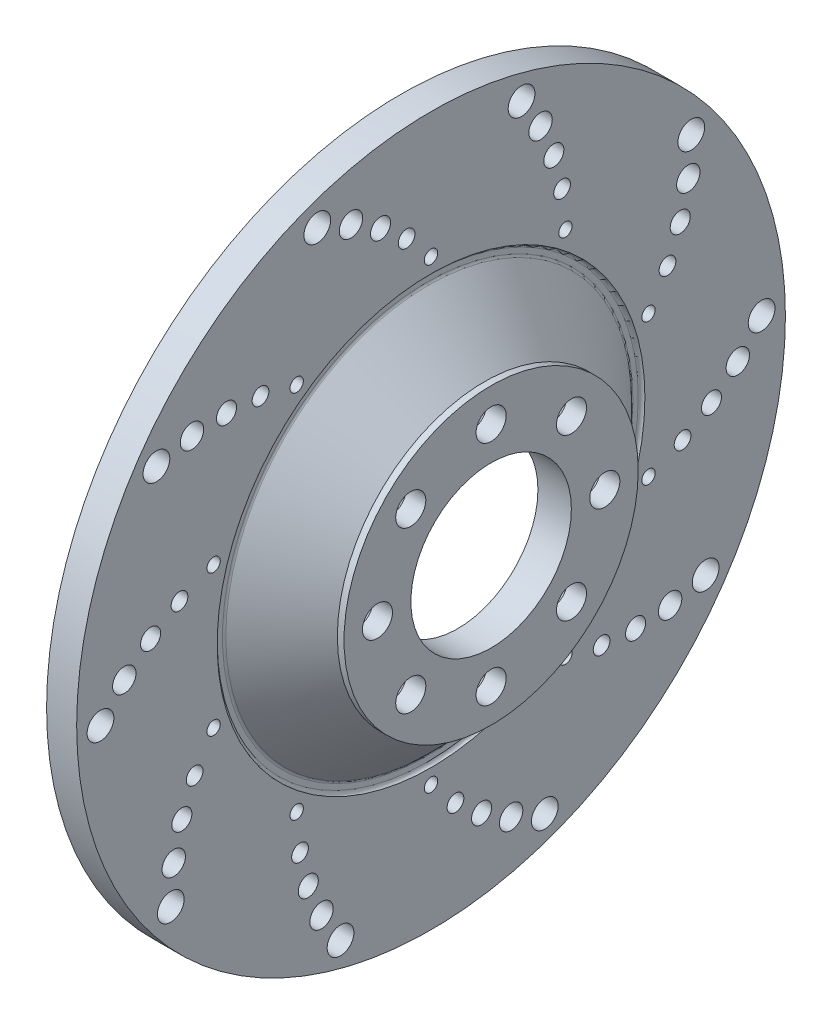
ISO-10303-21;
HEADER;
FILE_DESCRIPTION(('STEP AP214'),'2;1');
FILE_NAME('part.step','',(''),(''),'','','');
FILE_SCHEMA(('AUTOMOTIVE_DESIGN { 1 0 10303 214 1 1 1 1 }'));
ENDSEC;
DATA;
#1=APPLICATION_CONTEXT('core data for automotive mechanical design processes');
#2=APPLICATION_PROTOCOL_DEFINITION('international standard','automotive_design',2000,#1);
#3=PRODUCT_CONTEXT('',#1,'mechanical');
#4=PRODUCT('Part','Part','',(#3));
#5=PRODUCT_RELATED_PRODUCT_CATEGORY('part','',(#4));
#6=PRODUCT_DEFINITION_FORMATION('','',#4);
#7=PRODUCT_DEFINITION_CONTEXT('part definition',#1,'design');
#8=PRODUCT_DEFINITION('design','',#6,#7);
#9=PRODUCT_DEFINITION_SHAPE('','',#8);
#10=(LENGTH_UNIT() NAMED_UNIT(*) SI_UNIT(.MILLI.,.METRE.));
#11=(NAMED_UNIT(*) PLANE_ANGLE_UNIT() SI_UNIT($,.RADIAN.));
#12=(NAMED_UNIT(*) SI_UNIT($,.STERADIAN.) SOLID_ANGLE_UNIT());
#13=UNCERTAINTY_MEASURE_WITH_UNIT(LENGTH_MEASURE(1.E-05),#10,'distance_accuracy_value','');
#14=(GEOMETRIC_REPRESENTATION_CONTEXT(3) GLOBAL_UNCERTAINTY_ASSIGNED_CONTEXT((#13)) GLOBAL_UNIT_ASSIGNED_CONTEXT((#10,
#11,#12)) REPRESENTATION_CONTEXT('',''));
#15=CARTESIAN_POINT('',(0.,0.,0.));
#16=DIRECTION('',(0.,0.,1.));
#17=DIRECTION('',(1.,0.,0.));
#18=AXIS2_PLACEMENT_3D('',#15,#16,#17);
#19=CARTESIAN_POINT('',(0.,24.,0.));
#20=DIRECTION('',(1.,0.,0.));
#21=DIRECTION('',(0.,0.,-1.));
#22=AXIS2_PLACEMENT_3D('',#19,#20,#21);
#23=PLANE('',#22);
#24=CARTESIAN_POINT('',(0.,24.0416305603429,24.0416305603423));
#25=DIRECTION('',(-1.,0.,0.));
#26=DIRECTION('',(0.,0.,1.));
#27=AXIS2_PLACEMENT_3D('',#24,#25,#26);
#28=CIRCLE('',#27,4.5);
#29=CARTESIAN_POINT('',(0.,24.0416305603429,28.5416305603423));
#30=VERTEX_POINT('',#29);
#31=EDGE_CURVE('E157',#30,#30,#28,.T.);
#32=ORIENTED_EDGE('',*,*,#31,.T.);
#33=EDGE_LOOP('',(#32));
#34=FACE_BOUND('',#33,.T.);
#35=CARTESIAN_POINT('',(0.,3.58508115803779E-13,34.));
#36=DIRECTION('',(-1.,0.,0.));
#37=DIRECTION('',(0.,0.,1.));
#38=AXIS2_PLACEMENT_3D('',#35,#36,#37);
#39=CIRCLE('',#38,4.5);
#40=CARTESIAN_POINT('',(0.,3.58508115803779E-13,38.5));
#41=VERTEX_POINT('',#40);
#42=EDGE_CURVE('E148',#41,#41,#39,.T.);
#43=ORIENTED_EDGE('',*,*,#42,.T.);
#44=EDGE_LOOP('',(#43));
#45=FACE_BOUND('',#44,.T.);
#46=CARTESIAN_POINT('',(0.,-24.0416305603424,24.0416305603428));
#47=DIRECTION('',(-1.,0.,0.));
#48=DIRECTION('',(0.,0.,1.));
#49=AXIS2_PLACEMENT_3D('',#46,#47,#48);
#50=CIRCLE('',#49,4.5);
#51=CARTESIAN_POINT('',(0.,-24.0416305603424,28.5416305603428));
#52=VERTEX_POINT('',#51);
#53=EDGE_CURVE('E139',#52,#52,#50,.T.);
#54=ORIENTED_EDGE('',*,*,#53,.T.);
#55=EDGE_LOOP('',(#54));
#56=FACE_BOUND('',#55,.T.);
#57=CARTESIAN_POINT('',(0.,-34.,2.37902159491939E-13));
#58=DIRECTION('',(-1.,0.,0.));
#59=DIRECTION('',(0.,0.,1.));
#60=AXIS2_PLACEMENT_3D('',#57,#58,#59);
#61=CIRCLE('',#60,4.5);
#62=CARTESIAN_POINT('',(0.,-34.,4.50000000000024));
#63=VERTEX_POINT('',#62);
#64=EDGE_CURVE('E130',#63,#63,#61,.T.);
#65=ORIENTED_EDGE('',*,*,#64,.T.);
#66=EDGE_LOOP('',(#65));
#67=FACE_BOUND('',#66,.T.);
#68=CARTESIAN_POINT('',(0.,-24.0416305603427,-24.0416305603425));
#69=DIRECTION('',(-1.,0.,0.));
#70=DIRECTION('',(0.,0.,1.));
#71=AXIS2_PLACEMENT_3D('',#68,#69,#70);
#72=CIRCLE('',#71,4.5);
#73=CARTESIAN_POINT('',(0.,-24.0416305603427,-19.5416305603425));
#74=VERTEX_POINT('',#73);
#75=EDGE_CURVE('E121',#74,#74,#72,.T.);
#76=ORIENTED_EDGE('',*,*,#75,.T.);
#77=EDGE_LOOP('',(#76));
#78=FACE_BOUND('',#77,.T.);
#79=CARTESIAN_POINT('',(0.,-1.18540840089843E-13,-34.));
#80=DIRECTION('',(-1.,0.,0.));
#81=DIRECTION('',(0.,0.,1.));
#82=AXIS2_PLACEMENT_3D('',#79,#80,#81);
#83=CIRCLE('',#82,4.5);
#84=CARTESIAN_POINT('',(0.,-1.18540840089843E-13,-29.5));
#85=VERTEX_POINT('',#84);
#86=EDGE_CURVE('E112',#85,#85,#83,.T.);
#87=ORIENTED_EDGE('',*,*,#86,.T.);
#88=EDGE_LOOP('',(#87));
#89=FACE_BOUND('',#88,.T.);
#90=CARTESIAN_POINT('',(0.,0.,0.));
#91=DIRECTION('',(1.,0.,0.));
#92=DIRECTION('',(0.,0.,-1.));
#93=AXIS2_PLACEMENT_3D('',#90,#91,#92);
#94=CIRCLE('',#93,24.);
#95=CARTESIAN_POINT('',(0.,0.,-24.));
#96=VERTEX_POINT('',#95);
#97=EDGE_CURVE('E82',#96,#96,#94,.T.);
#98=ORIENTED_EDGE('',*,*,#97,.F.);
#99=EDGE_LOOP('',(#98));
#100=FACE_BOUND('',#99,.T.);
#101=CARTESIAN_POINT('',(0.,0.,0.));
#102=DIRECTION('',(1.,0.,0.));
#103=DIRECTION('',(0.,0.,-1.));
#104=AXIS2_PLACEMENT_3D('',#101,#102,#103);
#105=CIRCLE('',#104,44.);
#106=CARTESIAN_POINT('',(0.,0.,-44.));
#107=VERTEX_POINT('',#106);
#108=EDGE_CURVE('E85',#107,#107,#105,.T.);
#109=ORIENTED_EDGE('',*,*,#108,.T.);
#110=EDGE_LOOP('',(#109));
#111=FACE_BOUND('',#110,.T.);
#112=CARTESIAN_POINT('',(0.,34.,0.));
#113=DIRECTION('',(-1.,0.,0.));
#114=DIRECTION('',(0.,0.,1.));
#115=AXIS2_PLACEMENT_3D('',#112,#113,#114);
#116=CIRCLE('',#115,4.5);
#117=CARTESIAN_POINT('',(0.,34.,4.5));
#118=VERTEX_POINT('',#117);
#119=EDGE_CURVE('E94',#118,#118,#116,.T.);
#120=ORIENTED_EDGE('',*,*,#119,.T.);
#121=EDGE_LOOP('',(#120));
#122=FACE_BOUND('',#121,.T.);
#123=CARTESIAN_POINT('',(0.,24.0416305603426,-24.0416305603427));
#124=DIRECTION('',(-1.,0.,0.));
#125=DIRECTION('',(0.,0.,1.));
#126=AXIS2_PLACEMENT_3D('',#123,#124,#125);
#127=CIRCLE('',#126,4.5);
#128=CARTESIAN_POINT('',(0.,24.0416305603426,-19.5416305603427));
#129=VERTEX_POINT('',#128);
#130=EDGE_CURVE('E103',#129,#129,#127,.T.);
#131=ORIENTED_EDGE('',*,*,#130,.T.);
#132=EDGE_LOOP('',(#131));
#133=FACE_BOUND('',#132,.T.);
#134=ADVANCED_FACE('F32',(#34,#45,#56,#67,#78,#89,#100,#111,#122,#133),#23,.T.);
#135=CARTESIAN_POINT('',(0.,0.,0.));
#136=DIRECTION('',(1.,0.,0.));
#137=DIRECTION('',(0.,0.,-1.));
#138=AXIS2_PLACEMENT_3D('',#135,#136,#137);
#139=CYLINDRICAL_SURFACE('',#138,44.);
#140=CARTESIAN_POINT('',(-2.,0.,0.));
#141=DIRECTION('',(1.,0.,0.));
#142=DIRECTION('',(0.,0.,-1.));
#143=AXIS2_PLACEMENT_3D('',#140,#141,#142);
#144=CIRCLE('',#143,44.);
#145=CARTESIAN_POINT('',(-2.,0.,-44.));
#146=VERTEX_POINT('',#145);
#147=EDGE_CURVE('E58',#146,#146,#144,.T.);
#148=ORIENTED_EDGE('',*,*,#147,.T.);
#149=EDGE_LOOP('',(#148));
#150=FACE_BOUND('',#149,.T.);
#151=ORIENTED_EDGE('',*,*,#108,.F.);
#152=EDGE_LOOP('',(#151));
#153=FACE_BOUND('',#152,.T.);
#154=ADVANCED_FACE('F34',(#150,#153),#139,.T.);
#155=CARTESIAN_POINT('',(-2.,0.,0.));
#156=DIRECTION('',(-1.,0.,0.));
#157=DIRECTION('',(0.,0.,1.));
#158=AXIS2_PLACEMENT_3D('',#155,#156,#157);
#159=CONICAL_SURFACE('',#158,44.,0.78539816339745);
#160=CARTESIAN_POINT('',(-18.6776695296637,0.,0.));
#161=DIRECTION('',(-1.,0.,0.));
#162=DIRECTION('',(0.,0.,1.));
#163=AXIS2_PLACEMENT_3D('',#160,#161,#162);
#164=CIRCLE('',#163,60.6776695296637);
#165=CARTESIAN_POINT('',(-18.6776695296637,0.,60.6776695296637));
#166=VERTEX_POINT('',#165);
#167=EDGE_CURVE('E10',#166,#166,#164,.F.);
#168=ORIENTED_EDGE('',*,*,#167,.T.);
#169=EDGE_LOOP('',(#168));
#170=FACE_BOUND('',#169,.T.);
#171=ORIENTED_EDGE('',*,*,#147,.F.);
#172=EDGE_LOOP('',(#171));
#173=FACE_BOUND('',#172,.T.);
#174=ADVANCED_FACE('F603',(#170,#173),#159,.T.);
#175=CARTESIAN_POINT('',(-18.9705627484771,60.9705627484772,0.));
#176=DIRECTION('',(1.,0.,0.));
#177=DIRECTION('',(0.,0.,-1.));
#178=AXIS2_PLACEMENT_3D('',#175,#176,#177);
#179=PLANE('',#178);
#180=CARTESIAN_POINT('',(-18.9705627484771,0.,0.));
#181=DIRECTION('',(1.,0.,0.));
#182=DIRECTION('',(0.,0.,-1.));
#183=AXIS2_PLACEMENT_3D('',#180,#181,#182);
#184=CIRCLE('',#183,62.9705627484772);
#185=CARTESIAN_POINT('',(-18.9705627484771,0.,-62.9705627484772));
#186=VERTEX_POINT('',#185);
#187=EDGE_CURVE('E39',#186,#186,#184,.T.);
#188=ORIENTED_EDGE('',*,*,#187,.T.);
#189=EDGE_LOOP('',(#188));
#190=FACE_BOUND('',#189,.T.);
#191=CARTESIAN_POINT('',(-18.9705627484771,0.,0.));
#192=DIRECTION('',(1.,0.,0.));
#193=DIRECTION('',(0.,0.,-1.));
#194=AXIS2_PLACEMENT_3D('',#191,#192,#193);
#195=CIRCLE('',#194,61.3847763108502);
#196=CARTESIAN_POINT('',(-18.9705627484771,0.,-61.3847763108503));
#197=VERTEX_POINT('',#196);
#198=EDGE_CURVE('E43',#197,#197,#195,.F.);
#199=ORIENTED_EDGE('',*,*,#198,.T.);
#200=EDGE_LOOP('',(#199));
#201=FACE_BOUND('',#200,.T.);
#202=ADVANCED_FACE('F579',(#190,#201),#179,.T.);
#203=CARTESIAN_POINT('',(-17.9705627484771,63.9705627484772,0.));
#204=DIRECTION('',(1.,0.,0.));
#205=DIRECTION('',(0.,0.,-1.));
#206=AXIS2_PLACEMENT_3D('',#203,#204,#205);
#207=PLANE('',#206);
#208=CARTESIAN_POINT('',(-17.9705627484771,57.6758351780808,71.5087800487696));
#209=DIRECTION('',(1.,0.,0.));
#210=DIRECTION('',(0.,0.,-1.));
#211=AXIS2_PLACEMENT_3D('',#208,#209,#210);
#212=CIRCLE('',#211,3.5);
#213=CARTESIAN_POINT('',(-17.9705627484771,57.6758351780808,68.0087800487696));
#214=VERTEX_POINT('',#213);
#215=EDGE_CURVE('E454',#214,#214,#212,.T.);
#216=ORIENTED_EDGE('',*,*,#215,.F.);
#217=EDGE_LOOP('',(#216));
#218=FACE_BOUND('',#217,.T.);
#219=CARTESIAN_POINT('',(-17.9705627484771,57.7833820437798,51.0118001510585));
#220=DIRECTION('',(1.,0.,0.));
#221=DIRECTION('',(0.,0.,-1.));
#222=AXIS2_PLACEMENT_3D('',#219,#220,#221);
#223=CIRCLE('',#222,2.5);
#224=CARTESIAN_POINT('',(-17.9705627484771,57.7833820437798,48.5118001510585));
#225=VERTEX_POINT('',#224);
#226=EDGE_CURVE('E448',#225,#225,#223,.T.);
#227=ORIENTED_EDGE('',*,*,#226,.F.);
#228=EDGE_LOOP('',(#227));
#229=FACE_BOUND('',#228,.T.);
#230=CARTESIAN_POINT('',(-17.9705627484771,55.1562476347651,82.1392530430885));
#231=DIRECTION('',(1.,0.,0.));
#232=DIRECTION('',(0.,0.,-1.));
#233=AXIS2_PLACEMENT_3D('',#230,#231,#232);
#234=CIRCLE('',#233,4.00000000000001);
#235=CARTESIAN_POINT('',(-17.9705627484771,55.1562476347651,78.1392530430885));
#236=VERTEX_POINT('',#235);
#237=EDGE_CURVE('E442',#236,#236,#234,.T.);
#238=ORIENTED_EDGE('',*,*,#237,.F.);
#239=EDGE_LOOP('',(#238));
#240=FACE_BOUND('',#239,.T.);
#241=CARTESIAN_POINT('',(-17.9705627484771,58.4924575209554,61.1811054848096));
#242=DIRECTION('',(1.,0.,0.));
#243=DIRECTION('',(0.,0.,-1.));
#244=AXIS2_PLACEMENT_3D('',#241,#242,#243);
#245=CIRCLE('',#244,3.);
#246=CARTESIAN_POINT('',(-17.9705627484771,58.4924575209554,58.1811054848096));
#247=VERTEX_POINT('',#246);
#248=EDGE_CURVE('E436',#247,#247,#245,.T.);
#249=ORIENTED_EDGE('',*,*,#248,.F.);
#250=EDGE_LOOP('',(#249));
#251=FACE_BOUND('',#250,.T.);
#252=CARTESIAN_POINT('',(-17.9705627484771,55.3259408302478,40.1966489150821));
#253=DIRECTION('',(1.,0.,0.));
#254=DIRECTION('',(0.,0.,-1.));
#255=AXIS2_PLACEMENT_3D('',#252,#253,#254);
#256=CIRCLE('',#255,2.);
#257=CARTESIAN_POINT('',(-17.9705627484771,55.3259408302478,38.1966489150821));
#258=VERTEX_POINT('',#257);
#259=EDGE_CURVE('E430',#258,#258,#256,.T.);
#260=ORIENTED_EDGE('',*,*,#259,.F.);
#261=EDGE_LOOP('',(#260));
#262=FACE_BOUND('',#261,.T.);
#263=CARTESIAN_POINT('',(-17.9705627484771,4.62892450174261,91.7528236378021));
#264=DIRECTION('',(1.,0.,0.));
#265=DIRECTION('',(0.,0.,-1.));
#266=AXIS2_PLACEMENT_3D('',#263,#264,#265);
#267=CIRCLE('',#266,3.5);
#268=CARTESIAN_POINT('',(-17.9705627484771,4.62892450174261,88.2528236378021));
#269=VERTEX_POINT('',#268);
#270=EDGE_CURVE('E424',#269,#269,#267,.T.);
#271=ORIENTED_EDGE('',*,*,#270,.F.);
#272=EDGE_LOOP('',(#271));
#273=FACE_BOUND('',#272,.T.);
#274=CARTESIAN_POINT('',(-17.9705627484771,16.7637542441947,75.2336330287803));
#275=DIRECTION('',(1.,0.,0.));
#276=DIRECTION('',(0.,0.,-1.));
#277=AXIS2_PLACEMENT_3D('',#274,#275,#276);
#278=CIRCLE('',#277,2.5);
#279=CARTESIAN_POINT('',(-17.9705627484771,16.7637542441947,72.7336330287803));
#280=VERTEX_POINT('',#279);
#281=EDGE_CURVE('E418',#280,#280,#278,.T.);
#282=ORIENTED_EDGE('',*,*,#281,.F.);
#283=EDGE_LOOP('',(#282));
#284=FACE_BOUND('',#283,.T.);
#285=CARTESIAN_POINT('',(-17.9705627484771,-3.65789989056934,98.8720805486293));
#286=DIRECTION('',(1.,0.,0.));
#287=DIRECTION('',(0.,0.,-1.));
#288=AXIS2_PLACEMENT_3D('',#285,#286,#287);
#289=CIRCLE('',#288,4.00000000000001);
#290=CARTESIAN_POINT('',(-17.9705627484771,-3.65789989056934,94.8720805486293));
#291=VERTEX_POINT('',#290);
#292=EDGE_CURVE('E412',#291,#291,#289,.T.);
#293=ORIENTED_EDGE('',*,*,#292,.F.);
#294=EDGE_LOOP('',(#293));
#295=FACE_BOUND('',#294,.T.);
#296=CARTESIAN_POINT('',(-17.9705627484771,11.3600406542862,83.8775579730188));
#297=DIRECTION('',(1.,0.,0.));
#298=DIRECTION('',(0.,0.,-1.));
#299=AXIS2_PLACEMENT_3D('',#296,#297,#298);
#300=CIRCLE('',#299,3.);
#301=CARTESIAN_POINT('',(-17.9705627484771,11.3600406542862,80.8775579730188));
#302=VERTEX_POINT('',#301);
#303=EDGE_CURVE('E406',#302,#302,#300,.T.);
#304=ORIENTED_EDGE('',*,*,#303,.F.);
#305=EDGE_LOOP('',(#304));
#306=FACE_BOUND('',#305,.T.);
#307=CARTESIAN_POINT('',(-17.9705627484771,21.1326289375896,65.0395441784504));
#308=DIRECTION('',(1.,0.,0.));
#309=DIRECTION('',(0.,0.,-1.));
#310=AXIS2_PLACEMENT_3D('',#307,#308,#309);
#311=CIRCLE('',#310,2.);
#312=CARTESIAN_POINT('',(-17.9705627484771,21.1326289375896,63.0395441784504));
#313=VERTEX_POINT('',#312);
#314=EDGE_CURVE('E400',#313,#313,#311,.T.);
#315=ORIENTED_EDGE('',*,*,#314,.F.);
#316=EDGE_LOOP('',(#315));
#317=FACE_BOUND('',#316,.T.);
#318=CARTESIAN_POINT('',(-17.9705627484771,-50.1860780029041,76.9504071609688));
#319=DIRECTION('',(1.,0.,0.));
#320=DIRECTION('',(0.,0.,-1.));
#321=AXIS2_PLACEMENT_3D('',#318,#319,#320);
#322=CIRCLE('',#321,3.5);
#323=CARTESIAN_POINT('',(-17.9705627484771,-50.1860780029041,73.4504071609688));
#324=VERTEX_POINT('',#323);
#325=EDGE_CURVE('E394',#324,#324,#322,.T.);
#326=ORIENTED_EDGE('',*,*,#325,.F.);
#327=EDGE_LOOP('',(#326));
#328=FACE_BOUND('',#327,.T.);
#329=CARTESIAN_POINT('',(-17.9705627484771,-30.6590578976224,70.7187751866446));
#330=DIRECTION('',(1.,0.,0.));
#331=DIRECTION('',(0.,0.,-1.));
#332=AXIS2_PLACEMENT_3D('',#329,#330,#331);
#333=CIRCLE('',#332,2.5);
#334=CARTESIAN_POINT('',(-17.9705627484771,-30.6590578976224,68.2187751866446));
#335=VERTEX_POINT('',#334);
#336=EDGE_CURVE('E388',#335,#335,#333,.T.);
#337=ORIENTED_EDGE('',*,*,#336,.F.);
#338=EDGE_LOOP('',(#337));
#339=FACE_BOUND('',#338,.T.);
#340=CARTESIAN_POINT('',(-17.9705627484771,-61.0748539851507,77.8391338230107));
#341=DIRECTION('',(1.,0.,0.));
#342=DIRECTION('',(0.,0.,-1.));
#343=AXIS2_PLACEMENT_3D('',#340,#341,#342);
#344=CIRCLE('',#343,4.00000000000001);
#345=CARTESIAN_POINT('',(-17.9705627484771,-61.0748539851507,73.8391338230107));
#346=VERTEX_POINT('',#345);
#347=EDGE_CURVE('E382',#346,#346,#344,.T.);
#348=ORIENTED_EDGE('',*,*,#347,.F.);
#349=EDGE_LOOP('',(#348));
#350=FACE_BOUND('',#349,.T.);
#351=CARTESIAN_POINT('',(-17.9705627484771,-40.1115256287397,74.5356342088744));
#352=DIRECTION('',(1.,0.,0.));
#353=DIRECTION('',(0.,0.,-1.));
#354=AXIS2_PLACEMENT_3D('',#351,#352,#353);
#355=CIRCLE('',#354,3.);
#356=CARTESIAN_POINT('',(-17.9705627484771,-40.1115256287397,71.5356342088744));
#357=VERTEX_POINT('',#356);
#358=EDGE_CURVE('E376',#357,#357,#355,.T.);
#359=ORIENTED_EDGE('',*,*,#358,.F.);
#360=EDGE_LOOP('',(#359));
#361=FACE_BOUND('',#360,.T.);
#362=CARTESIAN_POINT('',(-17.9705627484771,-21.1326289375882,65.0395441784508));
#363=DIRECTION('',(1.,0.,0.));
#364=DIRECTION('',(0.,0.,-1.));
#365=AXIS2_PLACEMENT_3D('',#362,#363,#364);
#366=CIRCLE('',#365,2.);
#367=CARTESIAN_POINT('',(-17.9705627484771,-21.1326289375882,63.0395441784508));
#368=VERTEX_POINT('',#367);
#369=EDGE_CURVE('E370',#368,#368,#366,.T.);
#370=ORIENTED_EDGE('',*,*,#369,.F.);
#371=EDGE_LOOP('',(#370));
#372=FACE_BOUND('',#371,.T.);
#373=CARTESIAN_POINT('',(-17.9705627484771,-85.8317044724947,32.7555505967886));
#374=DIRECTION('',(1.,0.,0.));
#375=DIRECTION('',(0.,0.,-1.));
#376=AXIS2_PLACEMENT_3D('',#373,#374,#375);
#377=CIRCLE('',#376,3.5);
#378=CARTESIAN_POINT('',(-17.9705627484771,-85.8317044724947,29.2555505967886));
#379=VERTEX_POINT('',#378);
#380=EDGE_CURVE('E364',#379,#379,#377,.T.);
#381=ORIENTED_EDGE('',*,*,#380,.F.);
#382=EDGE_LOOP('',(#381));
#383=FACE_BOUND('',#382,.T.);
#384=CARTESIAN_POINT('',(-17.9705627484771,-66.3711519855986,39.1917488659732));
#385=DIRECTION('',(1.,0.,0.));
#386=DIRECTION('',(0.,0.,-1.));
#387=AXIS2_PLACEMENT_3D('',#384,#385,#386);
#388=CIRCLE('',#387,2.5);
#389=CARTESIAN_POINT('',(-17.9705627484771,-66.3711519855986,36.6917488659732));
#390=VERTEX_POINT('',#389);
#391=EDGE_CURVE('E358',#390,#390,#388,.T.);
#392=ORIENTED_EDGE('',*,*,#391,.F.);
#393=EDGE_LOOP('',(#392));
#394=FACE_BOUND('',#393,.T.);
#395=CARTESIAN_POINT('',(-17.9705627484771,-95.1632897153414,27.0742836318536));
#396=DIRECTION('',(1.,0.,0.));
#397=DIRECTION('',(0.,0.,-1.));
#398=AXIS2_PLACEMENT_3D('',#395,#396,#397);
#399=CIRCLE('',#398,4.00000000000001);
#400=CARTESIAN_POINT('',(-17.9705627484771,-95.1632897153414,23.0742836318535));
#401=VERTEX_POINT('',#400);
#402=EDGE_CURVE('E352',#401,#401,#399,.T.);
#403=ORIENTED_EDGE('',*,*,#402,.F.);
#404=EDGE_LOOP('',(#403));
#405=FACE_BOUND('',#404,.T.);
#406=CARTESIAN_POINT('',(-17.9705627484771,-76.2618524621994,36.7236315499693));
#407=DIRECTION('',(1.,0.,0.));
#408=DIRECTION('',(0.,0.,-1.));
#409=AXIS2_PLACEMENT_3D('',#406,#407,#408);
#410=CIRCLE('',#409,3.);
#411=CARTESIAN_POINT('',(-17.9705627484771,-76.2618524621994,33.7236315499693));
#412=VERTEX_POINT('',#411);
#413=EDGE_CURVE('E346',#412,#412,#410,.T.);
#414=ORIENTED_EDGE('',*,*,#413,.F.);
#415=EDGE_LOOP('',(#414));
#416=FACE_BOUND('',#415,.T.);
#417=CARTESIAN_POINT('',(-17.9705627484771,-55.3259408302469,40.1966489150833));
#418=DIRECTION('',(1.,0.,0.));
#419=DIRECTION('',(0.,0.,-1.));
#420=AXIS2_PLACEMENT_3D('',#417,#418,#419);
#421=CIRCLE('',#420,2.);
#422=CARTESIAN_POINT('',(-17.9705627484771,-55.3259408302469,38.1966489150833));
#423=VERTEX_POINT('',#422);
#424=EDGE_CURVE('E340',#423,#423,#421,.T.);
#425=ORIENTED_EDGE('',*,*,#424,.F.);
#426=EDGE_LOOP('',(#425));
#427=FACE_BOUND('',#426,.T.);
#428=CARTESIAN_POINT('',(-17.9705627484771,-88.6925371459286,-23.950812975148));
#429=DIRECTION('',(1.,0.,0.));
#430=DIRECTION('',(0.,0.,-1.));
#431=AXIS2_PLACEMENT_3D('',#428,#429,#430);
#432=CIRCLE('',#431,3.5);
#433=CARTESIAN_POINT('',(-17.9705627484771,-88.6925371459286,-27.450812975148));
#434=VERTEX_POINT('',#433);
#435=EDGE_CURVE('E334',#434,#434,#432,.T.);
#436=ORIENTED_EDGE('',*,*,#435,.F.);
#437=EDGE_LOOP('',(#436));
#438=FACE_BOUND('',#437,.T.);
#439=CARTESIAN_POINT('',(-17.9705627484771,-76.7317218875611,-7.30519344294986));
#440=DIRECTION('',(1.,0.,0.));
#441=DIRECTION('',(0.,0.,-1.));
#442=AXIS2_PLACEMENT_3D('',#439,#440,#441);
#443=CIRCLE('',#442,2.5);
#444=CARTESIAN_POINT('',(-17.9705627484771,-76.7317218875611,-9.80519344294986));
#445=VERTEX_POINT('',#444);
#446=EDGE_CURVE('E328',#445,#445,#443,.T.);
#447=ORIENTED_EDGE('',*,*,#446,.F.);
#448=EDGE_LOOP('',(#447));
#449=FACE_BOUND('',#448,.T.);
#450=CARTESIAN_POINT('',(-17.9705627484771,-92.9025832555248,-34.0320226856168));
#451=DIRECTION('',(1.,0.,0.));
#452=DIRECTION('',(0.,0.,-1.));
#453=AXIS2_PLACEMENT_3D('',#450,#451,#452);
#454=CIRCLE('',#453,4.00000000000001);
#455=CARTESIAN_POINT('',(-17.9705627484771,-92.9025832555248,-38.0320226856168));
#456=VERTEX_POINT('',#455);
#457=EDGE_CURVE('E322',#456,#456,#454,.T.);
#458=ORIENTED_EDGE('',*,*,#457,.F.);
#459=EDGE_LOOP('',(#458));
#460=FACE_BOUND('',#459,.T.);
#461=CARTESIAN_POINT('',(-17.9705627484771,-83.2827437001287,-15.1155501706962));
#462=DIRECTION('',(1.,0.,0.));
#463=DIRECTION('',(0.,0.,-1.));
#464=AXIS2_PLACEMENT_3D('',#461,#462,#463);
#465=CIRCLE('',#464,3.);
#466=CARTESIAN_POINT('',(-17.9705627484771,-83.2827437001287,-18.1155501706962));
#467=VERTEX_POINT('',#466);
#468=EDGE_CURVE('E316',#467,#467,#465,.T.);
#469=ORIENTED_EDGE('',*,*,#468,.F.);
#470=EDGE_LOOP('',(#469));
#471=FACE_BOUND('',#470,.T.);
#472=CARTESIAN_POINT('',(-17.9705627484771,-68.3866237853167,4.81480748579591E-13));
#473=DIRECTION('',(1.,0.,0.));
#474=DIRECTION('',(0.,0.,-1.));
#475=AXIS2_PLACEMENT_3D('',#472,#473,#474);
#476=CIRCLE('',#475,2.);
#477=CARTESIAN_POINT('',(-17.9705627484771,-68.3866237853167,-1.99999999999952));
#478=VERTEX_POINT('',#477);
#479=EDGE_CURVE('E310',#478,#478,#476,.T.);
#480=ORIENTED_EDGE('',*,*,#479,.F.);
#481=EDGE_LOOP('',(#480));
#482=FACE_BOUND('',#481,.T.);
#483=CARTESIAN_POINT('',(-17.9705627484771,-57.6758351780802,-71.50878004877));
#484=DIRECTION('',(1.,0.,0.));
#485=DIRECTION('',(0.,0.,-1.));
#486=AXIS2_PLACEMENT_3D('',#483,#484,#485);
#487=CIRCLE('',#486,3.5);
#488=CARTESIAN_POINT('',(-17.9705627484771,-57.6758351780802,-75.00878004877));
#489=VERTEX_POINT('',#488);
#490=EDGE_CURVE('E304',#489,#489,#487,.T.);
#491=ORIENTED_EDGE('',*,*,#490,.F.);
#492=EDGE_LOOP('',(#491));
#493=FACE_BOUND('',#492,.T.);
#494=CARTESIAN_POINT('',(-17.9705627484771,-57.7833820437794,-51.0118001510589));
#495=DIRECTION('',(1.,0.,0.));
#496=DIRECTION('',(0.,0.,-1.));
#497=AXIS2_PLACEMENT_3D('',#494,#495,#496);
#498=CIRCLE('',#497,2.5);
#499=CARTESIAN_POINT('',(-17.9705627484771,-57.7833820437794,-53.5118001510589));
#500=VERTEX_POINT('',#499);
#501=EDGE_CURVE('E298',#500,#500,#498,.T.);
#502=ORIENTED_EDGE('',*,*,#501,.F.);
#503=EDGE_LOOP('',(#502));
#504=FACE_BOUND('',#503,.T.);
#505=CARTESIAN_POINT('',(-17.9705627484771,-55.1562476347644,-82.139253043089));
#506=DIRECTION('',(1.,0.,0.));
#507=DIRECTION('',(0.,0.,-1.));
#508=AXIS2_PLACEMENT_3D('',#505,#506,#507);
#509=CIRCLE('',#508,4.00000000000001);
#510=CARTESIAN_POINT('',(-17.9705627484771,-55.1562476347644,-86.139253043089));
#511=VERTEX_POINT('',#510);
#512=EDGE_CURVE('E292',#511,#511,#509,.T.);
#513=ORIENTED_EDGE('',*,*,#512,.F.);
#514=EDGE_LOOP('',(#513));
#515=FACE_BOUND('',#514,.T.);
#516=CARTESIAN_POINT('',(-17.9705627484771,-58.4924575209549,-61.18110548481));
#517=DIRECTION('',(1.,0.,0.));
#518=DIRECTION('',(0.,0.,-1.));
#519=AXIS2_PLACEMENT_3D('',#516,#517,#518);
#520=CIRCLE('',#519,3.);
#521=CARTESIAN_POINT('',(-17.9705627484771,-58.4924575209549,-64.18110548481));
#522=VERTEX_POINT('',#521);
#523=EDGE_CURVE('E286',#522,#522,#520,.T.);
#524=ORIENTED_EDGE('',*,*,#523,.F.);
#525=EDGE_LOOP('',(#524));
#526=FACE_BOUND('',#525,.T.);
#527=CARTESIAN_POINT('',(-17.9705627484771,-55.3259408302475,-40.1966489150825));
#528=DIRECTION('',(1.,0.,0.));
#529=DIRECTION('',(0.,0.,-1.));
#530=AXIS2_PLACEMENT_3D('',#527,#528,#529);
#531=CIRCLE('',#530,2.);
#532=CARTESIAN_POINT('',(-17.9705627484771,-55.3259408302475,-42.1966489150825));
#533=VERTEX_POINT('',#532);
#534=EDGE_CURVE('E280',#533,#533,#531,.T.);
#535=ORIENTED_EDGE('',*,*,#534,.F.);
#536=EDGE_LOOP('',(#535));
#537=FACE_BOUND('',#536,.T.);
#538=CARTESIAN_POINT('',(-17.9705627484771,-4.62892450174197,-91.7528236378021));
#539=DIRECTION('',(1.,0.,0.));
#540=DIRECTION('',(0.,0.,-1.));
#541=AXIS2_PLACEMENT_3D('',#538,#539,#540);
#542=CIRCLE('',#541,3.5);
#543=CARTESIAN_POINT('',(-17.9705627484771,-4.62892450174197,-95.2528236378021));
#544=VERTEX_POINT('',#543);
#545=EDGE_CURVE('E274',#544,#544,#542,.T.);
#546=ORIENTED_EDGE('',*,*,#545,.F.);
#547=EDGE_LOOP('',(#546));
#548=FACE_BOUND('',#547,.T.);
#549=CARTESIAN_POINT('',(-17.9705627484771,-16.7637542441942,-75.2336330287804));
#550=DIRECTION('',(1.,0.,0.));
#551=DIRECTION('',(0.,0.,-1.));
#552=AXIS2_PLACEMENT_3D('',#549,#550,#551);
#553=CIRCLE('',#552,2.5);
#554=CARTESIAN_POINT('',(-17.9705627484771,-16.7637542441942,-77.7336330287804));
#555=VERTEX_POINT('',#554);
#556=EDGE_CURVE('E268',#555,#555,#553,.T.);
#557=ORIENTED_EDGE('',*,*,#556,.F.);
#558=EDGE_LOOP('',(#557));
#559=FACE_BOUND('',#558,.T.);
#560=CARTESIAN_POINT('',(-17.9705627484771,3.65789989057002,-98.8720805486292));
#561=DIRECTION('',(1.,0.,0.));
#562=DIRECTION('',(0.,0.,-1.));
#563=AXIS2_PLACEMENT_3D('',#560,#561,#562);
#564=CIRCLE('',#563,4.00000000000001);
#565=CARTESIAN_POINT('',(-17.9705627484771,3.65789989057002,-102.872080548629));
#566=VERTEX_POINT('',#565);
#567=EDGE_CURVE('E262',#566,#566,#564,.T.);
#568=ORIENTED_EDGE('',*,*,#567,.F.);
#569=EDGE_LOOP('',(#568));
#570=FACE_BOUND('',#569,.T.);
#571=CARTESIAN_POINT('',(-17.9705627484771,-11.3600406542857,-83.8775579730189));
#572=DIRECTION('',(1.,0.,0.));
#573=DIRECTION('',(0.,0.,-1.));
#574=AXIS2_PLACEMENT_3D('',#571,#572,#573);
#575=CIRCLE('',#574,3.);
#576=CARTESIAN_POINT('',(-17.9705627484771,-11.3600406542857,-86.8775579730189));
#577=VERTEX_POINT('',#576);
#578=EDGE_CURVE('E256',#577,#577,#575,.T.);
#579=ORIENTED_EDGE('',*,*,#578,.F.);
#580=EDGE_LOOP('',(#579));
#581=FACE_BOUND('',#580,.T.);
#582=CARTESIAN_POINT('',(-17.9705627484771,-21.1326289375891,-65.0395441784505));
#583=DIRECTION('',(1.,0.,0.));
#584=DIRECTION('',(0.,0.,-1.));
#585=AXIS2_PLACEMENT_3D('',#582,#583,#584);
#586=CIRCLE('',#585,2.);
#587=CARTESIAN_POINT('',(-17.9705627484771,-21.1326289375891,-67.0395441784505));
#588=VERTEX_POINT('',#587);
#589=EDGE_CURVE('E250',#588,#588,#586,.T.);
#590=ORIENTED_EDGE('',*,*,#589,.F.);
#591=EDGE_LOOP('',(#590));
#592=FACE_BOUND('',#591,.T.);
#593=CARTESIAN_POINT('',(-17.9705627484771,50.1860780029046,-76.9504071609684));
#594=DIRECTION('',(1.,0.,0.));
#595=DIRECTION('',(0.,0.,-1.));
#596=AXIS2_PLACEMENT_3D('',#593,#594,#595);
#597=CIRCLE('',#596,3.5);
#598=CARTESIAN_POINT('',(-17.9705627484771,50.1860780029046,-80.4504071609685));
#599=VERTEX_POINT('',#598);
#600=EDGE_CURVE('E244',#599,#599,#597,.T.);
#601=ORIENTED_EDGE('',*,*,#600,.F.);
#602=EDGE_LOOP('',(#601));
#603=FACE_BOUND('',#602,.T.);
#604=CARTESIAN_POINT('',(-17.9705627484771,30.6590578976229,-70.7187751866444));
#605=DIRECTION('',(1.,0.,0.));
#606=DIRECTION('',(0.,0.,-1.));
#607=AXIS2_PLACEMENT_3D('',#604,#605,#606);
#608=CIRCLE('',#607,2.5);
#609=CARTESIAN_POINT('',(-17.9705627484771,30.6590578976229,-73.2187751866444));
#610=VERTEX_POINT('',#609);
#611=EDGE_CURVE('E238',#610,#610,#608,.T.);
#612=ORIENTED_EDGE('',*,*,#611,.F.);
#613=EDGE_LOOP('',(#612));
#614=FACE_BOUND('',#613,.T.);
#615=CARTESIAN_POINT('',(-17.9705627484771,61.0748539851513,-77.8391338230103));
#616=DIRECTION('',(1.,0.,0.));
#617=DIRECTION('',(0.,0.,-1.));
#618=AXIS2_PLACEMENT_3D('',#615,#616,#617);
#619=CIRCLE('',#618,4.00000000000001);
#620=CARTESIAN_POINT('',(-17.9705627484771,61.0748539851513,-81.8391338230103));
#621=VERTEX_POINT('',#620);
#622=EDGE_CURVE('E232',#621,#621,#619,.T.);
#623=ORIENTED_EDGE('',*,*,#622,.F.);
#624=EDGE_LOOP('',(#623));
#625=FACE_BOUND('',#624,.T.);
#626=CARTESIAN_POINT('',(-17.9705627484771,40.1115256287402,-74.5356342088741));
#627=DIRECTION('',(1.,0.,0.));
#628=DIRECTION('',(0.,0.,-1.));
#629=AXIS2_PLACEMENT_3D('',#626,#627,#628);
#630=CIRCLE('',#629,3.);
#631=CARTESIAN_POINT('',(-17.9705627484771,40.1115256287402,-77.5356342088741));
#632=VERTEX_POINT('',#631);
#633=EDGE_CURVE('E226',#632,#632,#630,.T.);
#634=ORIENTED_EDGE('',*,*,#633,.F.);
#635=EDGE_LOOP('',(#634));
#636=FACE_BOUND('',#635,.T.);
#637=CARTESIAN_POINT('',(-17.9705627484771,21.1326289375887,-65.0395441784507));
#638=DIRECTION('',(1.,0.,0.));
#639=DIRECTION('',(0.,0.,-1.));
#640=AXIS2_PLACEMENT_3D('',#637,#638,#639);
#641=CIRCLE('',#640,2.);
#642=CARTESIAN_POINT('',(-17.9705627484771,21.1326289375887,-67.0395441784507));
#643=VERTEX_POINT('',#642);
#644=EDGE_CURVE('E220',#643,#643,#641,.T.);
#645=ORIENTED_EDGE('',*,*,#644,.F.);
#646=EDGE_LOOP('',(#645));
#647=FACE_BOUND('',#646,.T.);
#648=CARTESIAN_POINT('',(-17.9705627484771,85.8317044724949,-32.755550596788));
#649=DIRECTION('',(1.,0.,0.));
#650=DIRECTION('',(0.,0.,-1.));
#651=AXIS2_PLACEMENT_3D('',#648,#649,#650);
#652=CIRCLE('',#651,3.5);
#653=CARTESIAN_POINT('',(-17.9705627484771,85.8317044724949,-36.255550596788));
#654=VERTEX_POINT('',#653);
#655=EDGE_CURVE('E214',#654,#654,#652,.T.);
#656=ORIENTED_EDGE('',*,*,#655,.F.);
#657=EDGE_LOOP('',(#656));
#658=FACE_BOUND('',#657,.T.);
#659=CARTESIAN_POINT('',(-17.9705627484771,66.3711519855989,-39.1917488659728));
#660=DIRECTION('',(1.,0.,0.));
#661=DIRECTION('',(0.,0.,-1.));
#662=AXIS2_PLACEMENT_3D('',#659,#660,#661);
#663=CIRCLE('',#662,2.5);
#664=CARTESIAN_POINT('',(-17.9705627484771,66.3711519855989,-41.6917488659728));
#665=VERTEX_POINT('',#664);
#666=EDGE_CURVE('E208',#665,#665,#663,.T.);
#667=ORIENTED_EDGE('',*,*,#666,.F.);
#668=EDGE_LOOP('',(#667));
#669=FACE_BOUND('',#668,.T.);
#670=CARTESIAN_POINT('',(-17.9705627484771,95.1632897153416,-27.0742836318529));
#671=DIRECTION('',(1.,0.,0.));
#672=DIRECTION('',(0.,0.,-1.));
#673=AXIS2_PLACEMENT_3D('',#670,#671,#672);
#674=CIRCLE('',#673,4.00000000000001);
#675=CARTESIAN_POINT('',(-17.9705627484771,95.1632897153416,-31.0742836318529));
#676=VERTEX_POINT('',#675);
#677=EDGE_CURVE('E202',#676,#676,#674,.T.);
#678=ORIENTED_EDGE('',*,*,#677,.F.);
#679=EDGE_LOOP('',(#678));
#680=FACE_BOUND('',#679,.T.);
#681=CARTESIAN_POINT('',(-17.9705627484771,76.2618524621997,-36.7236315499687));
#682=DIRECTION('',(1.,0.,0.));
#683=DIRECTION('',(0.,0.,-1.));
#684=AXIS2_PLACEMENT_3D('',#681,#682,#683);
#685=CIRCLE('',#684,3.);
#686=CARTESIAN_POINT('',(-17.9705627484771,76.2618524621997,-39.7236315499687));
#687=VERTEX_POINT('',#686);
#688=EDGE_CURVE('E196',#687,#687,#685,.T.);
#689=ORIENTED_EDGE('',*,*,#688,.F.);
#690=EDGE_LOOP('',(#689));
#691=FACE_BOUND('',#690,.T.);
#692=CARTESIAN_POINT('',(-17.9705627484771,55.3259408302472,-40.1966489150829));
#693=DIRECTION('',(1.,0.,0.));
#694=DIRECTION('',(0.,0.,-1.));
#695=AXIS2_PLACEMENT_3D('',#692,#693,#694);
#696=CIRCLE('',#695,2.);
#697=CARTESIAN_POINT('',(-17.9705627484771,55.3259408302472,-42.1966489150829));
#698=VERTEX_POINT('',#697);
#699=EDGE_CURVE('E190',#698,#698,#696,.T.);
#700=ORIENTED_EDGE('',*,*,#699,.F.);
#701=EDGE_LOOP('',(#700));
#702=FACE_BOUND('',#701,.T.);
#703=CARTESIAN_POINT('',(-17.9705627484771,88.6925371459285,23.9508129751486));
#704=DIRECTION('',(1.,0.,0.));
#705=DIRECTION('',(0.,0.,-1.));
#706=AXIS2_PLACEMENT_3D('',#703,#704,#705);
#707=CIRCLE('',#706,3.5);
#708=CARTESIAN_POINT('',(-17.9705627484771,88.6925371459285,20.4508129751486));
#709=VERTEX_POINT('',#708);
#710=EDGE_CURVE('E184',#709,#709,#707,.T.);
#711=ORIENTED_EDGE('',*,*,#710,.F.);
#712=EDGE_LOOP('',(#711));
#713=FACE_BOUND('',#712,.T.);
#714=CARTESIAN_POINT('',(-17.9705627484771,76.7317218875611,7.3051934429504));
#715=DIRECTION('',(1.,0.,0.));
#716=DIRECTION('',(0.,0.,-1.));
#717=AXIS2_PLACEMENT_3D('',#714,#715,#716);
#718=CIRCLE('',#717,2.5);
#719=CARTESIAN_POINT('',(-17.9705627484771,76.7317218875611,4.80519344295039));
#720=VERTEX_POINT('',#719);
#721=EDGE_CURVE('E178',#720,#720,#718,.T.);
#722=ORIENTED_EDGE('',*,*,#721,.F.);
#723=EDGE_LOOP('',(#722));
#724=FACE_BOUND('',#723,.T.);
#725=CARTESIAN_POINT('',(-17.9705627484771,92.9025832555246,34.0320226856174));
#726=DIRECTION('',(1.,0.,0.));
#727=DIRECTION('',(0.,0.,-1.));
#728=AXIS2_PLACEMENT_3D('',#725,#726,#727);
#729=CIRCLE('',#728,4.00000000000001);
#730=CARTESIAN_POINT('',(-17.9705627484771,92.9025832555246,30.0320226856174));
#731=VERTEX_POINT('',#730);
#732=EDGE_CURVE('E172',#731,#731,#729,.T.);
#733=ORIENTED_EDGE('',*,*,#732,.F.);
#734=EDGE_LOOP('',(#733));
#735=FACE_BOUND('',#734,.T.);
#736=CARTESIAN_POINT('',(-17.9705627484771,83.2827437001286,15.1155501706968));
#737=DIRECTION('',(1.,0.,0.));
#738=DIRECTION('',(0.,0.,-1.));
#739=AXIS2_PLACEMENT_3D('',#736,#737,#738);
#740=CIRCLE('',#739,3.);
#741=CARTESIAN_POINT('',(-17.9705627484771,83.2827437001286,12.1155501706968));
#742=VERTEX_POINT('',#741);
#743=EDGE_CURVE('E166',#742,#742,#740,.T.);
#744=ORIENTED_EDGE('',*,*,#743,.F.);
#745=EDGE_LOOP('',(#744));
#746=FACE_BOUND('',#745,.T.);
#747=CARTESIAN_POINT('',(-17.9705627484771,68.3866237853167,0.));
#748=DIRECTION('',(1.,0.,0.));
#749=DIRECTION('',(0.,0.,-1.));
#750=AXIS2_PLACEMENT_3D('',#747,#748,#749);
#751=CIRCLE('',#750,2.);
#752=CARTESIAN_POINT('',(-17.9705627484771,68.3866237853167,-2.00000000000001));
#753=VERTEX_POINT('',#752);
#754=EDGE_CURVE('E160',#753,#753,#751,.T.);
#755=ORIENTED_EDGE('',*,*,#754,.F.);
#756=EDGE_LOOP('',(#755));
#757=FACE_BOUND('',#756,.T.);
#758=CARTESIAN_POINT('',(-17.9705627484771,0.,0.));
#759=DIRECTION('',(1.,0.,0.));
#760=DIRECTION('',(0.,0.,-1.));
#761=AXIS2_PLACEMENT_3D('',#758,#759,#760);
#762=CIRCLE('',#761,106.);
#763=CARTESIAN_POINT('',(-17.9705627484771,0.,-106.));
#764=VERTEX_POINT('',#763);
#765=EDGE_CURVE('E64',#764,#764,#762,.T.);
#766=ORIENTED_EDGE('',*,*,#765,.T.);
#767=EDGE_LOOP('',(#766));
#768=FACE_BOUND('',#767,.T.);
#769=CARTESIAN_POINT('',(-17.9705627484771,0.,0.));
#770=DIRECTION('',(1.,0.,0.));
#771=DIRECTION('',(0.,0.,-1.));
#772=AXIS2_PLACEMENT_3D('',#769,#770,#771);
#773=CIRCLE('',#772,63.9705627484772);
#774=CARTESIAN_POINT('',(-17.9705627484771,0.,-63.9705627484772));
#775=VERTEX_POINT('',#774);
#776=EDGE_CURVE('E61',#775,#775,#773,.T.);
#777=ORIENTED_EDGE('',*,*,#776,.F.);
#778=EDGE_LOOP('',(#777));
#779=FACE_BOUND('',#778,.T.);
#780=ADVANCED_FACE('F573',(#218,#229,#240,#251,#262,#273,#284,#295,#306,#317,#328,#339,#350,
#361,#372,#383,#394,#405,#416,#427,#438,#449,#460,#471,#482,#493,#504,#515,#526,#537,#548,#559,
#570,#581,#592,#603,#614,#625,#636,#647,#658,#669,#680,#691,#702,#713,#724,#735,#746,#757,#768,
#779),#207,.T.);
#781=CARTESIAN_POINT('',(0.,0.,0.));
#782=DIRECTION('',(1.,0.,0.));
#783=DIRECTION('',(0.,0.,-1.));
#784=AXIS2_PLACEMENT_3D('',#781,#782,#783);
#785=CYLINDRICAL_SURFACE('',#784,106.);
#786=CARTESIAN_POINT('',(-26.9705627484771,0.,0.));
#787=DIRECTION('',(1.,0.,0.));
#788=DIRECTION('',(0.,0.,-1.));
#789=AXIS2_PLACEMENT_3D('',#786,#787,#788);
#790=CIRCLE('',#789,106.);
#791=CARTESIAN_POINT('',(-26.9705627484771,0.,-106.));
#792=VERTEX_POINT('',#791);
#793=EDGE_CURVE('E67',#792,#792,#790,.T.);
#794=ORIENTED_EDGE('',*,*,#793,.T.);
#795=EDGE_LOOP('',(#794));
#796=FACE_BOUND('',#795,.T.);
#797=ORIENTED_EDGE('',*,*,#765,.F.);
#798=EDGE_LOOP('',(#797));
#799=FACE_BOUND('',#798,.T.);
#800=ADVANCED_FACE('F467',(#796,#799),#785,.T.);
#801=CARTESIAN_POINT('',(-26.9705627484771,106.,0.));
#802=DIRECTION('',(-1.,0.,0.));
#803=DIRECTION('',(0.,0.,1.));
#804=AXIS2_PLACEMENT_3D('',#801,#802,#803);
#805=PLANE('',#804);
#806=CARTESIAN_POINT('',(-26.9705627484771,57.6758351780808,71.5087800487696));
#807=DIRECTION('',(-1.,0.,0.));
#808=DIRECTION('',(0.,-0.587785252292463,0.809016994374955));
#809=AXIS2_PLACEMENT_3D('',#806,#807,#808);
#810=CIRCLE('',#809,3.5);
#811=CARTESIAN_POINT('',(-26.9705627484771,55.6185867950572,74.3403395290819));
#812=VERTEX_POINT('',#811);
#813=EDGE_CURVE('E457',#812,#812,#810,.T.);
#814=ORIENTED_EDGE('',*,*,#813,.F.);
#815=EDGE_LOOP('',(#814));
#816=FACE_BOUND('',#815,.T.);
#817=CARTESIAN_POINT('',(-26.9705627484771,57.7833820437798,51.0118001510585));
#818=DIRECTION('',(-1.,0.,0.));
#819=DIRECTION('',(0.,-0.587785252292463,0.809016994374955));
#820=AXIS2_PLACEMENT_3D('',#817,#818,#819);
#821=CIRCLE('',#820,2.5);
#822=CARTESIAN_POINT('',(-26.9705627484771,56.3139189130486,53.0343426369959));
#823=VERTEX_POINT('',#822);
#824=EDGE_CURVE('E451',#823,#823,#821,.T.);
#825=ORIENTED_EDGE('',*,*,#824,.F.);
#826=EDGE_LOOP('',(#825));
#827=FACE_BOUND('',#826,.T.);
#828=CARTESIAN_POINT('',(-26.9705627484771,55.1562476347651,82.1392530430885));
#829=DIRECTION('',(-1.,0.,0.));
#830=DIRECTION('',(0.,-0.587785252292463,0.809016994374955));
#831=AXIS2_PLACEMENT_3D('',#828,#829,#830);
#832=CIRCLE('',#831,4.00000000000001);
#833=CARTESIAN_POINT('',(-26.9705627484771,52.8051066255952,85.3753210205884));
#834=VERTEX_POINT('',#833);
#835=EDGE_CURVE('E445',#834,#834,#832,.T.);
#836=ORIENTED_EDGE('',*,*,#835,.F.);
#837=EDGE_LOOP('',(#836));
#838=FACE_BOUND('',#837,.T.);
#839=CARTESIAN_POINT('',(-26.9705627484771,58.4924575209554,61.1811054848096));
#840=DIRECTION('',(-1.,0.,0.));
#841=DIRECTION('',(0.,-0.587785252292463,0.809016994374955));
#842=AXIS2_PLACEMENT_3D('',#839,#840,#841);
#843=CIRCLE('',#842,3.);
#844=CARTESIAN_POINT('',(-26.9705627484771,56.729101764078,63.6081564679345));
#845=VERTEX_POINT('',#844);
#846=EDGE_CURVE('E439',#845,#845,#843,.T.);
#847=ORIENTED_EDGE('',*,*,#846,.F.);
#848=EDGE_LOOP('',(#847));
#849=FACE_BOUND('',#848,.T.);
#850=CARTESIAN_POINT('',(-26.9705627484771,55.3259408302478,40.1966489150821));
#851=DIRECTION('',(-1.,0.,0.));
#852=DIRECTION('',(0.,-0.587785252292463,0.809016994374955));
#853=AXIS2_PLACEMENT_3D('',#850,#851,#852);
#854=CIRCLE('',#853,2.);
#855=CARTESIAN_POINT('',(-26.9705627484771,54.1503703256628,41.814682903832));
#856=VERTEX_POINT('',#855);
#857=EDGE_CURVE('E433',#856,#856,#854,.T.);
#858=ORIENTED_EDGE('',*,*,#857,.F.);
#859=EDGE_LOOP('',(#858));
#860=FACE_BOUND('',#859,.T.);
#861=CARTESIAN_POINT('',(-26.9705627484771,4.62892450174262,91.7528236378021));
#862=DIRECTION('',(-1.,0.,0.));
#863=DIRECTION('',(0.,-0.951056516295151,0.309016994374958));
#864=AXIS2_PLACEMENT_3D('',#861,#862,#863);
#865=CIRCLE('',#864,3.5);
#866=CARTESIAN_POINT('',(-26.9705627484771,1.30022669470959,92.8343831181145));
#867=VERTEX_POINT('',#866);
#868=EDGE_CURVE('E427',#867,#867,#865,.T.);
#869=ORIENTED_EDGE('',*,*,#868,.F.);
#870=EDGE_LOOP('',(#869));
#871=FACE_BOUND('',#870,.T.);
#872=CARTESIAN_POINT('',(-26.9705627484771,16.7637542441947,75.2336330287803));
#873=DIRECTION('',(-1.,0.,0.));
#874=DIRECTION('',(0.,-0.951056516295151,0.309016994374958));
#875=AXIS2_PLACEMENT_3D('',#872,#873,#874);
#876=CIRCLE('',#875,2.5);
#877=CARTESIAN_POINT('',(-26.9705627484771,14.3861129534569,76.0061755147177));
#878=VERTEX_POINT('',#877);
#879=EDGE_CURVE('E421',#878,#878,#876,.T.);
#880=ORIENTED_EDGE('',*,*,#879,.F.);
#881=EDGE_LOOP('',(#880));
#882=FACE_BOUND('',#881,.T.);
#883=CARTESIAN_POINT('',(-26.9705627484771,-3.65789989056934,98.8720805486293));
#884=DIRECTION('',(-1.,0.,0.));
#885=DIRECTION('',(0.,-0.951056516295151,0.309016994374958));
#886=AXIS2_PLACEMENT_3D('',#883,#884,#885);
#887=CIRCLE('',#886,4.00000000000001);
#888=CARTESIAN_POINT('',(-26.9705627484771,-7.46212595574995,100.108148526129));
#889=VERTEX_POINT('',#888);
#890=EDGE_CURVE('E415',#889,#889,#887,.T.);
#891=ORIENTED_EDGE('',*,*,#890,.F.);
#892=EDGE_LOOP('',(#891));
#893=FACE_BOUND('',#892,.T.);
#894=CARTESIAN_POINT('',(-26.9705627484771,11.3600406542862,83.8775579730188));
#895=DIRECTION('',(-1.,0.,0.));
#896=DIRECTION('',(0.,-0.951056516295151,0.309016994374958));
#897=AXIS2_PLACEMENT_3D('',#894,#895,#896);
#898=CIRCLE('',#897,3.);
#899=CARTESIAN_POINT('',(-26.9705627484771,8.50687110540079,84.8046089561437));
#900=VERTEX_POINT('',#899);
#901=EDGE_CURVE('E409',#900,#900,#898,.T.);
#902=ORIENTED_EDGE('',*,*,#901,.F.);
#903=EDGE_LOOP('',(#902));
#904=FACE_BOUND('',#903,.T.);
#905=CARTESIAN_POINT('',(-26.9705627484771,21.1326289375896,65.0395441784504));
#906=DIRECTION('',(-1.,0.,0.));
#907=DIRECTION('',(0.,-0.951056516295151,0.309016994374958));
#908=AXIS2_PLACEMENT_3D('',#905,#906,#907);
#909=CIRCLE('',#908,2.);
#910=CARTESIAN_POINT('',(-26.9705627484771,19.2305159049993,65.6575781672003));
#911=VERTEX_POINT('',#910);
#912=EDGE_CURVE('E403',#911,#911,#909,.T.);
#913=ORIENTED_EDGE('',*,*,#912,.F.);
#914=EDGE_LOOP('',(#913));
#915=FACE_BOUND('',#914,.T.);
#916=CARTESIAN_POINT('',(-26.9705627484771,-50.1860780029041,76.9504071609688));
#917=DIRECTION('',(-1.,0.,0.));
#918=DIRECTION('',(0.,-0.951056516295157,-0.309016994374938));
#919=AXIS2_PLACEMENT_3D('',#916,#917,#918);
#920=CIRCLE('',#919,3.5);
#921=CARTESIAN_POINT('',(-26.9705627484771,-53.5147758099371,75.8688476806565));
#922=VERTEX_POINT('',#921);
#923=EDGE_CURVE('E397',#922,#922,#920,.T.);
#924=ORIENTED_EDGE('',*,*,#923,.F.);
#925=EDGE_LOOP('',(#924));
#926=FACE_BOUND('',#925,.T.);
#927=CARTESIAN_POINT('',(-26.9705627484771,-30.6590578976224,70.7187751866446));
#928=DIRECTION('',(-1.,0.,0.));
#929=DIRECTION('',(0.,-0.951056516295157,-0.309016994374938));
#930=AXIS2_PLACEMENT_3D('',#927,#928,#929);
#931=CIRCLE('',#930,2.5);
#932=CARTESIAN_POINT('',(-26.9705627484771,-33.0366991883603,69.9462327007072));
#933=VERTEX_POINT('',#932);
#934=EDGE_CURVE('E391',#933,#933,#931,.T.);
#935=ORIENTED_EDGE('',*,*,#934,.F.);
#936=EDGE_LOOP('',(#935));
#937=FACE_BOUND('',#936,.T.);
#938=CARTESIAN_POINT('',(-26.9705627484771,-61.0748539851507,77.8391338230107));
#939=DIRECTION('',(-1.,0.,0.));
#940=DIRECTION('',(0.,-0.951056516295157,-0.309016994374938));
#941=AXIS2_PLACEMENT_3D('',#938,#939,#940);
#942=CIRCLE('',#941,4.00000000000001);
#943=CARTESIAN_POINT('',(-26.9705627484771,-64.8790800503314,76.603065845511));
#944=VERTEX_POINT('',#943);
#945=EDGE_CURVE('E385',#944,#944,#942,.T.);
#946=ORIENTED_EDGE('',*,*,#945,.F.);
#947=EDGE_LOOP('',(#946));
#948=FACE_BOUND('',#947,.T.);
#949=CARTESIAN_POINT('',(-26.9705627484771,-40.1115256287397,74.5356342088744));
#950=DIRECTION('',(-1.,0.,0.));
#951=DIRECTION('',(0.,-0.951056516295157,-0.309016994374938));
#952=AXIS2_PLACEMENT_3D('',#949,#950,#951);
#953=CIRCLE('',#952,3.);
#954=CARTESIAN_POINT('',(-26.9705627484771,-42.9646951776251,73.6085832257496));
#955=VERTEX_POINT('',#954);
#956=EDGE_CURVE('E379',#955,#955,#953,.T.);
#957=ORIENTED_EDGE('',*,*,#956,.F.);
#958=EDGE_LOOP('',(#957));
#959=FACE_BOUND('',#958,.T.);
#960=CARTESIAN_POINT('',(-26.9705627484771,-21.1326289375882,65.0395441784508));
#961=DIRECTION('',(-1.,0.,0.));
#962=DIRECTION('',(0.,-0.951056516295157,-0.309016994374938));
#963=AXIS2_PLACEMENT_3D('',#960,#961,#962);
#964=CIRCLE('',#963,2.);
#965=CARTESIAN_POINT('',(-26.9705627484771,-23.0347419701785,64.4215101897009));
#966=VERTEX_POINT('',#965);
#967=EDGE_CURVE('E373',#966,#966,#964,.T.);
#968=ORIENTED_EDGE('',*,*,#967,.F.);
#969=EDGE_LOOP('',(#968));
#970=FACE_BOUND('',#969,.T.);
#971=CARTESIAN_POINT('',(-26.9705627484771,-85.8317044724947,32.7555505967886));
#972=DIRECTION('',(-1.,0.,0.));
#973=DIRECTION('',(0.,-0.587785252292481,-0.809016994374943));
#974=AXIS2_PLACEMENT_3D('',#971,#972,#973);
#975=CIRCLE('',#974,3.5);
#976=CARTESIAN_POINT('',(-26.9705627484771,-87.8889528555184,29.9239911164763));
#977=VERTEX_POINT('',#976);
#978=EDGE_CURVE('E367',#977,#977,#975,.T.);
#979=ORIENTED_EDGE('',*,*,#978,.F.);
#980=EDGE_LOOP('',(#979));
#981=FACE_BOUND('',#980,.T.);
#982=CARTESIAN_POINT('',(-26.9705627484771,-66.3711519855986,39.1917488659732));
#983=DIRECTION('',(-1.,0.,0.));
#984=DIRECTION('',(0.,-0.587785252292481,-0.809016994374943));
#985=AXIS2_PLACEMENT_3D('',#982,#983,#984);
#986=CIRCLE('',#985,2.5);
#987=CARTESIAN_POINT('',(-26.9705627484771,-67.8406151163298,37.1692063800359));
#988=VERTEX_POINT('',#987);
#989=EDGE_CURVE('E361',#988,#988,#986,.T.);
#990=ORIENTED_EDGE('',*,*,#989,.F.);
#991=EDGE_LOOP('',(#990));
#992=FACE_BOUND('',#991,.T.);
#993=CARTESIAN_POINT('',(-26.9705627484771,-95.1632897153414,27.0742836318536));
#994=DIRECTION('',(-1.,0.,0.));
#995=DIRECTION('',(0.,-0.587785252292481,-0.809016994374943));
#996=AXIS2_PLACEMENT_3D('',#993,#994,#995);
#997=CIRCLE('',#996,4.00000000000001);
#998=CARTESIAN_POINT('',(-26.9705627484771,-97.5144307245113,23.8382156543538));
#999=VERTEX_POINT('',#998);
#1000=EDGE_CURVE('E355',#999,#999,#997,.T.);
#1001=ORIENTED_EDGE('',*,*,#1000,.F.);
#1002=EDGE_LOOP('',(#1001));
#1003=FACE_BOUND('',#1002,.T.);
#1004=CARTESIAN_POINT('',(-26.9705627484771,-76.2618524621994,36.7236315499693));
#1005=DIRECTION('',(-1.,0.,0.));
#1006=DIRECTION('',(0.,-0.587785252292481,-0.809016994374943));
#1007=AXIS2_PLACEMENT_3D('',#1004,#1005,#1006);
#1008=CIRCLE('',#1007,3.);
#1009=CARTESIAN_POINT('',(-26.9705627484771,-78.0252082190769,34.2965805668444));
#1010=VERTEX_POINT('',#1009);
#1011=EDGE_CURVE('E349',#1010,#1010,#1008,.T.);
#1012=ORIENTED_EDGE('',*,*,#1011,.F.);
#1013=EDGE_LOOP('',(#1012));
#1014=FACE_BOUND('',#1013,.T.);
#1015=CARTESIAN_POINT('',(-26.9705627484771,-55.3259408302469,40.1966489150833));
#1016=DIRECTION('',(-1.,0.,0.));
#1017=DIRECTION('',(0.,-0.587785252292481,-0.809016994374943));
#1018=AXIS2_PLACEMENT_3D('',#1015,#1016,#1017);
#1019=CIRCLE('',#1018,2.);
#1020=CARTESIAN_POINT('',(-26.9705627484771,-56.5015113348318,38.5786149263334));
#1021=VERTEX_POINT('',#1020);
#1022=EDGE_CURVE('E343',#1021,#1021,#1019,.T.);
#1023=ORIENTED_EDGE('',*,*,#1022,.F.);
#1024=EDGE_LOOP('',(#1023));
#1025=FACE_BOUND('',#1024,.T.);
#1026=CARTESIAN_POINT('',(-26.9705627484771,-88.6925371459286,-23.950812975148));
#1027=DIRECTION('',(-1.,0.,0.));
#1028=DIRECTION('',(0.,0.,-1.));
#1029=AXIS2_PLACEMENT_3D('',#1026,#1027,#1028);
#1030=CIRCLE('',#1029,3.5);
#1031=CARTESIAN_POINT('',(-26.9705627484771,-88.6925371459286,-27.450812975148));
#1032=VERTEX_POINT('',#1031);
#1033=EDGE_CURVE('E337',#1032,#1032,#1030,.T.);
#1034=ORIENTED_EDGE('',*,*,#1033,.F.);
#1035=EDGE_LOOP('',(#1034));
#1036=FACE_BOUND('',#1035,.T.);
#1037=CARTESIAN_POINT('',(-26.9705627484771,-76.7317218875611,-7.30519344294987));
#1038=DIRECTION('',(-1.,0.,0.));
#1039=DIRECTION('',(0.,0.,-1.));
#1040=AXIS2_PLACEMENT_3D('',#1037,#1038,#1039);
#1041=CIRCLE('',#1040,2.5);
#1042=CARTESIAN_POINT('',(-26.9705627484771,-76.7317218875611,-9.80519344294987));
#1043=VERTEX_POINT('',#1042);
#1044=EDGE_CURVE('E331',#1043,#1043,#1041,.T.);
#1045=ORIENTED_EDGE('',*,*,#1044,.F.);
#1046=EDGE_LOOP('',(#1045));
#1047=FACE_BOUND('',#1046,.T.);
#1048=CARTESIAN_POINT('',(-26.9705627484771,-92.9025832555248,-34.0320226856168));
#1049=DIRECTION('',(-1.,0.,0.));
#1050=DIRECTION('',(0.,0.,-1.));
#1051=AXIS2_PLACEMENT_3D('',#1048,#1049,#1050);
#1052=CIRCLE('',#1051,4.00000000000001);
#1053=CARTESIAN_POINT('',(-26.9705627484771,-92.9025832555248,-38.0320226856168));
#1054=VERTEX_POINT('',#1053);
#1055=EDGE_CURVE('E325',#1054,#1054,#1052,.T.);
#1056=ORIENTED_EDGE('',*,*,#1055,.F.);
#1057=EDGE_LOOP('',(#1056));
#1058=FACE_BOUND('',#1057,.T.);
#1059=CARTESIAN_POINT('',(-26.9705627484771,-83.2827437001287,-15.1155501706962));
#1060=DIRECTION('',(-1.,0.,0.));
#1061=DIRECTION('',(0.,0.,-1.));
#1062=AXIS2_PLACEMENT_3D('',#1059,#1060,#1061);
#1063=CIRCLE('',#1062,3.);
#1064=CARTESIAN_POINT('',(-26.9705627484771,-83.2827437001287,-18.1155501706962));
#1065=VERTEX_POINT('',#1064);
#1066=EDGE_CURVE('E319',#1065,#1065,#1063,.T.);
#1067=ORIENTED_EDGE('',*,*,#1066,.F.);
#1068=EDGE_LOOP('',(#1067));
#1069=FACE_BOUND('',#1068,.T.);
#1070=CARTESIAN_POINT('',(-26.9705627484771,-68.3866237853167,4.82703086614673E-13));
#1071=DIRECTION('',(-1.,0.,0.));
#1072=DIRECTION('',(0.,0.,-1.));
#1073=AXIS2_PLACEMENT_3D('',#1070,#1071,#1072);
#1074=CIRCLE('',#1073,2.);
#1075=CARTESIAN_POINT('',(-26.9705627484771,-68.3866237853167,-1.99999999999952));
#1076=VERTEX_POINT('',#1075);
#1077=EDGE_CURVE('E313',#1076,#1076,#1074,.T.);
#1078=ORIENTED_EDGE('',*,*,#1077,.F.);
#1079=EDGE_LOOP('',(#1078));
#1080=FACE_BOUND('',#1079,.T.);
#1081=CARTESIAN_POINT('',(-26.9705627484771,-57.6758351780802,-71.50878004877));
#1082=DIRECTION('',(-1.,0.,0.));
#1083=DIRECTION('',(0.,0.587785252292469,-0.809016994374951));
#1084=AXIS2_PLACEMENT_3D('',#1081,#1082,#1083);
#1085=CIRCLE('',#1084,3.5);
#1086=CARTESIAN_POINT('',(-26.9705627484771,-55.6185867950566,-74.3403395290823));
#1087=VERTEX_POINT('',#1086);
#1088=EDGE_CURVE('E307',#1087,#1087,#1085,.T.);
#1089=ORIENTED_EDGE('',*,*,#1088,.F.);
#1090=EDGE_LOOP('',(#1089));
#1091=FACE_BOUND('',#1090,.T.);
#1092=CARTESIAN_POINT('',(-26.9705627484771,-57.7833820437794,-51.0118001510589));
#1093=DIRECTION('',(-1.,0.,0.));
#1094=DIRECTION('',(0.,0.587785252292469,-0.809016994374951));
#1095=AXIS2_PLACEMENT_3D('',#1092,#1093,#1094);
#1096=CIRCLE('',#1095,2.5);
#1097=CARTESIAN_POINT('',(-26.9705627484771,-56.3139189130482,-53.0343426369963));
#1098=VERTEX_POINT('',#1097);
#1099=EDGE_CURVE('E301',#1098,#1098,#1096,.T.);
#1100=ORIENTED_EDGE('',*,*,#1099,.F.);
#1101=EDGE_LOOP('',(#1100));
#1102=FACE_BOUND('',#1101,.T.);
#1103=CARTESIAN_POINT('',(-26.9705627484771,-55.1562476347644,-82.1392530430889));
#1104=DIRECTION('',(-1.,0.,0.));
#1105=DIRECTION('',(0.,0.587785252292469,-0.809016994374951));
#1106=AXIS2_PLACEMENT_3D('',#1103,#1104,#1105);
#1107=CIRCLE('',#1106,4.00000000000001);
#1108=CARTESIAN_POINT('',(-26.9705627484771,-52.8051066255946,-85.3753210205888));
#1109=VERTEX_POINT('',#1108);
#1110=EDGE_CURVE('E295',#1109,#1109,#1107,.T.);
#1111=ORIENTED_EDGE('',*,*,#1110,.F.);
#1112=EDGE_LOOP('',(#1111));
#1113=FACE_BOUND('',#1112,.T.);
#1114=CARTESIAN_POINT('',(-26.9705627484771,-58.4924575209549,-61.18110548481));
#1115=DIRECTION('',(-1.,0.,0.));
#1116=DIRECTION('',(0.,0.587785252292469,-0.809016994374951));
#1117=AXIS2_PLACEMENT_3D('',#1114,#1115,#1116);
#1118=CIRCLE('',#1117,3.);
#1119=CARTESIAN_POINT('',(-26.9705627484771,-56.7291017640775,-63.6081564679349));
#1120=VERTEX_POINT('',#1119);
#1121=EDGE_CURVE('E289',#1120,#1120,#1118,.T.);
#1122=ORIENTED_EDGE('',*,*,#1121,.F.);
#1123=EDGE_LOOP('',(#1122));
#1124=FACE_BOUND('',#1123,.T.);
#1125=CARTESIAN_POINT('',(-26.9705627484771,-55.3259408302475,-40.1966489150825));
#1126=DIRECTION('',(-1.,0.,0.));
#1127=DIRECTION('',(0.,0.587785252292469,-0.809016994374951));
#1128=AXIS2_PLACEMENT_3D('',#1125,#1126,#1127);
#1129=CIRCLE('',#1128,2.);
#1130=CARTESIAN_POINT('',(-26.9705627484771,-54.1503703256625,-41.8146829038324));
#1131=VERTEX_POINT('',#1130);
#1132=EDGE_CURVE('E283',#1131,#1131,#1129,.T.);
#1133=ORIENTED_EDGE('',*,*,#1132,.F.);
#1134=EDGE_LOOP('',(#1133));
#1135=FACE_BOUND('',#1134,.T.);
#1136=CARTESIAN_POINT('',(-26.9705627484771,-4.62892450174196,-91.7528236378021));
#1137=DIRECTION('',(-1.,0.,0.));
#1138=DIRECTION('',(0.,0.951056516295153,-0.309016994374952));
#1139=AXIS2_PLACEMENT_3D('',#1136,#1137,#1138);
#1140=CIRCLE('',#1139,3.5);
#1141=CARTESIAN_POINT('',(-26.9705627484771,-1.30022669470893,-92.8343831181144));
#1142=VERTEX_POINT('',#1141);
#1143=EDGE_CURVE('E277',#1142,#1142,#1140,.T.);
#1144=ORIENTED_EDGE('',*,*,#1143,.F.);
#1145=EDGE_LOOP('',(#1144));
#1146=FACE_BOUND('',#1145,.T.);
#1147=CARTESIAN_POINT('',(-26.9705627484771,-16.7637542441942,-75.2336330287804));
#1148=DIRECTION('',(-1.,0.,0.));
#1149=DIRECTION('',(0.,0.951056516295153,-0.309016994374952));
#1150=AXIS2_PLACEMENT_3D('',#1147,#1148,#1149);
#1151=CIRCLE('',#1150,2.5);
#1152=CARTESIAN_POINT('',(-26.9705627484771,-14.3861129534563,-76.0061755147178));
#1153=VERTEX_POINT('',#1152);
#1154=EDGE_CURVE('E271',#1153,#1153,#1151,.T.);
#1155=ORIENTED_EDGE('',*,*,#1154,.F.);
#1156=EDGE_LOOP('',(#1155));
#1157=FACE_BOUND('',#1156,.T.);
#1158=CARTESIAN_POINT('',(-26.9705627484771,3.65789989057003,-98.8720805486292));
#1159=DIRECTION('',(-1.,0.,0.));
#1160=DIRECTION('',(0.,0.951056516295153,-0.309016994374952));
#1161=AXIS2_PLACEMENT_3D('',#1158,#1159,#1160);
#1162=CIRCLE('',#1161,4.00000000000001);
#1163=CARTESIAN_POINT('',(-26.9705627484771,7.46212595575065,-100.108148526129));
#1164=VERTEX_POINT('',#1163);
#1165=EDGE_CURVE('E265',#1164,#1164,#1162,.T.);
#1166=ORIENTED_EDGE('',*,*,#1165,.F.);
#1167=EDGE_LOOP('',(#1166));
#1168=FACE_BOUND('',#1167,.T.);
#1169=CARTESIAN_POINT('',(-26.9705627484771,-11.3600406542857,-83.8775579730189));
#1170=DIRECTION('',(-1.,0.,0.));
#1171=DIRECTION('',(0.,0.951056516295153,-0.309016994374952));
#1172=AXIS2_PLACEMENT_3D('',#1169,#1170,#1171);
#1173=CIRCLE('',#1172,3.);
#1174=CARTESIAN_POINT('',(-26.9705627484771,-8.5068711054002,-84.8046089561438));
#1175=VERTEX_POINT('',#1174);
#1176=EDGE_CURVE('E259',#1175,#1175,#1173,.T.);
#1177=ORIENTED_EDGE('',*,*,#1176,.F.);
#1178=EDGE_LOOP('',(#1177));
#1179=FACE_BOUND('',#1178,.T.);
#1180=CARTESIAN_POINT('',(-26.9705627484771,-21.1326289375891,-65.0395441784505));
#1181=DIRECTION('',(-1.,0.,0.));
#1182=DIRECTION('',(0.,0.951056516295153,-0.309016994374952));
#1183=AXIS2_PLACEMENT_3D('',#1180,#1181,#1182);
#1184=CIRCLE('',#1183,2.);
#1185=CARTESIAN_POINT('',(-26.9705627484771,-19.2305159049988,-65.6575781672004));
#1186=VERTEX_POINT('',#1185);
#1187=EDGE_CURVE('E253',#1186,#1186,#1184,.T.);
#1188=ORIENTED_EDGE('',*,*,#1187,.F.);
#1189=EDGE_LOOP('',(#1188));
#1190=FACE_BOUND('',#1189,.T.);
#1191=CARTESIAN_POINT('',(-26.9705627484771,50.1860780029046,-76.9504071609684));
#1192=DIRECTION('',(-1.,0.,0.));
#1193=DIRECTION('',(0.,0.951056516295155,0.309016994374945));
#1194=AXIS2_PLACEMENT_3D('',#1191,#1192,#1193);
#1195=CIRCLE('',#1194,3.5);
#1196=CARTESIAN_POINT('',(-26.9705627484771,53.5147758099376,-75.8688476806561));
#1197=VERTEX_POINT('',#1196);
#1198=EDGE_CURVE('E247',#1197,#1197,#1195,.T.);
#1199=ORIENTED_EDGE('',*,*,#1198,.F.);
#1200=EDGE_LOOP('',(#1199));
#1201=FACE_BOUND('',#1200,.T.);
#1202=CARTESIAN_POINT('',(-26.9705627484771,30.6590578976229,-70.7187751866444));
#1203=DIRECTION('',(-1.,0.,0.));
#1204=DIRECTION('',(0.,0.951056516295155,0.309016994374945));
#1205=AXIS2_PLACEMENT_3D('',#1202,#1203,#1204);
#1206=CIRCLE('',#1205,2.5);
#1207=CARTESIAN_POINT('',(-26.9705627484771,33.0366991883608,-69.946232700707));
#1208=VERTEX_POINT('',#1207);
#1209=EDGE_CURVE('E241',#1208,#1208,#1206,.T.);
#1210=ORIENTED_EDGE('',*,*,#1209,.F.);
#1211=EDGE_LOOP('',(#1210));
#1212=FACE_BOUND('',#1211,.T.);
#1213=CARTESIAN_POINT('',(-26.9705627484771,61.0748539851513,-77.8391338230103));
#1214=DIRECTION('',(-1.,0.,0.));
#1215=DIRECTION('',(0.,0.951056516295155,0.309016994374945));
#1216=AXIS2_PLACEMENT_3D('',#1213,#1214,#1215);
#1217=CIRCLE('',#1216,4.00000000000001);
#1218=CARTESIAN_POINT('',(-26.9705627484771,64.8790800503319,-76.6030658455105));
#1219=VERTEX_POINT('',#1218);
#1220=EDGE_CURVE('E235',#1219,#1219,#1217,.T.);
#1221=ORIENTED_EDGE('',*,*,#1220,.F.);
#1222=EDGE_LOOP('',(#1221));
#1223=FACE_BOUND('',#1222,.T.);
#1224=CARTESIAN_POINT('',(-26.9705627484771,40.1115256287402,-74.5356342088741));
#1225=DIRECTION('',(-1.,0.,0.));
#1226=DIRECTION('',(0.,0.951056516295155,0.309016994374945));
#1227=AXIS2_PLACEMENT_3D('',#1224,#1225,#1226);
#1228=CIRCLE('',#1227,3.);
#1229=CARTESIAN_POINT('',(-26.9705627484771,42.9646951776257,-73.6085832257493));
#1230=VERTEX_POINT('',#1229);
#1231=EDGE_CURVE('E229',#1230,#1230,#1228,.T.);
#1232=ORIENTED_EDGE('',*,*,#1231,.F.);
#1233=EDGE_LOOP('',(#1232));
#1234=FACE_BOUND('',#1233,.T.);
#1235=CARTESIAN_POINT('',(-26.9705627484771,21.1326289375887,-65.0395441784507));
#1236=DIRECTION('',(-1.,0.,0.));
#1237=DIRECTION('',(0.,0.951056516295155,0.309016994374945));
#1238=AXIS2_PLACEMENT_3D('',#1235,#1236,#1237);
#1239=CIRCLE('',#1238,2.);
#1240=CARTESIAN_POINT('',(-26.9705627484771,23.034741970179,-64.4215101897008));
#1241=VERTEX_POINT('',#1240);
#1242=EDGE_CURVE('E223',#1241,#1241,#1239,.T.);
#1243=ORIENTED_EDGE('',*,*,#1242,.F.);
#1244=EDGE_LOOP('',(#1243));
#1245=FACE_BOUND('',#1244,.T.);
#1246=CARTESIAN_POINT('',(-26.9705627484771,85.8317044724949,-32.755550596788));
#1247=DIRECTION('',(-1.,0.,0.));
#1248=DIRECTION('',(0.,0.587785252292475,0.809016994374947));
#1249=AXIS2_PLACEMENT_3D('',#1246,#1247,#1248);
#1250=CIRCLE('',#1249,3.5);
#1251=CARTESIAN_POINT('',(-26.9705627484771,87.8889528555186,-29.9239911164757));
#1252=VERTEX_POINT('',#1251);
#1253=EDGE_CURVE('E217',#1252,#1252,#1250,.T.);
#1254=ORIENTED_EDGE('',*,*,#1253,.F.);
#1255=EDGE_LOOP('',(#1254));
#1256=FACE_BOUND('',#1255,.T.);
#1257=CARTESIAN_POINT('',(-26.9705627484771,66.3711519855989,-39.1917488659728));
#1258=DIRECTION('',(-1.,0.,0.));
#1259=DIRECTION('',(0.,0.587785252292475,0.809016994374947));
#1260=AXIS2_PLACEMENT_3D('',#1257,#1258,#1259);
#1261=CIRCLE('',#1260,2.5);
#1262=CARTESIAN_POINT('',(-26.9705627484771,67.8406151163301,-37.1692063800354));
#1263=VERTEX_POINT('',#1262);
#1264=EDGE_CURVE('E211',#1263,#1263,#1261,.T.);
#1265=ORIENTED_EDGE('',*,*,#1264,.F.);
#1266=EDGE_LOOP('',(#1265));
#1267=FACE_BOUND('',#1266,.T.);
#1268=CARTESIAN_POINT('',(-26.9705627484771,95.1632897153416,-27.0742836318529));
#1269=DIRECTION('',(-1.,0.,0.));
#1270=DIRECTION('',(0.,0.587785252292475,0.809016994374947));
#1271=AXIS2_PLACEMENT_3D('',#1268,#1269,#1270);
#1272=CIRCLE('',#1271,4.00000000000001);
#1273=CARTESIAN_POINT('',(-26.9705627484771,97.5144307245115,-23.8382156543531));
#1274=VERTEX_POINT('',#1273);
#1275=EDGE_CURVE('E205',#1274,#1274,#1272,.T.);
#1276=ORIENTED_EDGE('',*,*,#1275,.F.);
#1277=EDGE_LOOP('',(#1276));
#1278=FACE_BOUND('',#1277,.T.);
#1279=CARTESIAN_POINT('',(-26.9705627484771,76.2618524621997,-36.7236315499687));
#1280=DIRECTION('',(-1.,0.,0.));
#1281=DIRECTION('',(0.,0.587785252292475,0.809016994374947));
#1282=AXIS2_PLACEMENT_3D('',#1279,#1280,#1281);
#1283=CIRCLE('',#1282,3.);
#1284=CARTESIAN_POINT('',(-26.9705627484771,78.0252082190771,-34.2965805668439));
#1285=VERTEX_POINT('',#1284);
#1286=EDGE_CURVE('E199',#1285,#1285,#1283,.T.);
#1287=ORIENTED_EDGE('',*,*,#1286,.F.);
#1288=EDGE_LOOP('',(#1287));
#1289=FACE_BOUND('',#1288,.T.);
#1290=CARTESIAN_POINT('',(-26.9705627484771,55.3259408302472,-40.1966489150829));
#1291=DIRECTION('',(-1.,0.,0.));
#1292=DIRECTION('',(0.,0.587785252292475,0.809016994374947));
#1293=AXIS2_PLACEMENT_3D('',#1290,#1291,#1292);
#1294=CIRCLE('',#1293,2.);
#1295=CARTESIAN_POINT('',(-26.9705627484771,56.5015113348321,-38.578614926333));
#1296=VERTEX_POINT('',#1295);
#1297=EDGE_CURVE('E193',#1296,#1296,#1294,.T.);
#1298=ORIENTED_EDGE('',*,*,#1297,.F.);
#1299=EDGE_LOOP('',(#1298));
#1300=FACE_BOUND('',#1299,.T.);
#1301=CARTESIAN_POINT('',(-26.9705627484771,88.6925371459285,23.9508129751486));
#1302=DIRECTION('',(-1.,0.,0.));
#1303=DIRECTION('',(0.,0.,1.));
#1304=AXIS2_PLACEMENT_3D('',#1301,#1302,#1303);
#1305=CIRCLE('',#1304,3.5);
#1306=CARTESIAN_POINT('',(-26.9705627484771,88.6925371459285,27.4508129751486));
#1307=VERTEX_POINT('',#1306);
#1308=EDGE_CURVE('E187',#1307,#1307,#1305,.T.);
#1309=ORIENTED_EDGE('',*,*,#1308,.F.);
#1310=EDGE_LOOP('',(#1309));
#1311=FACE_BOUND('',#1310,.T.);
#1312=CARTESIAN_POINT('',(-26.9705627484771,76.7317218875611,7.30519344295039));
#1313=DIRECTION('',(-1.,0.,0.));
#1314=DIRECTION('',(0.,0.,1.));
#1315=AXIS2_PLACEMENT_3D('',#1312,#1313,#1314);
#1316=CIRCLE('',#1315,2.5);
#1317=CARTESIAN_POINT('',(-26.9705627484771,76.7317218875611,9.8051934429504));
#1318=VERTEX_POINT('',#1317);
#1319=EDGE_CURVE('E181',#1318,#1318,#1316,.T.);
#1320=ORIENTED_EDGE('',*,*,#1319,.F.);
#1321=EDGE_LOOP('',(#1320));
#1322=FACE_BOUND('',#1321,.T.);
#1323=CARTESIAN_POINT('',(-26.9705627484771,92.9025832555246,34.0320226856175));
#1324=DIRECTION('',(-1.,0.,0.));
#1325=DIRECTION('',(0.,0.,1.));
#1326=AXIS2_PLACEMENT_3D('',#1323,#1324,#1325);
#1327=CIRCLE('',#1326,4.00000000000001);
#1328=CARTESIAN_POINT('',(-26.9705627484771,92.9025832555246,38.0320226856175));
#1329=VERTEX_POINT('',#1328);
#1330=EDGE_CURVE('E175',#1329,#1329,#1327,.T.);
#1331=ORIENTED_EDGE('',*,*,#1330,.F.);
#1332=EDGE_LOOP('',(#1331));
#1333=FACE_BOUND('',#1332,.T.);
#1334=CARTESIAN_POINT('',(-26.9705627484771,83.2827437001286,15.1155501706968));
#1335=DIRECTION('',(-1.,0.,0.));
#1336=DIRECTION('',(0.,0.,1.));
#1337=AXIS2_PLACEMENT_3D('',#1334,#1335,#1336);
#1338=CIRCLE('',#1337,3.);
#1339=CARTESIAN_POINT('',(-26.9705627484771,83.2827437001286,18.1155501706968));
#1340=VERTEX_POINT('',#1339);
#1341=EDGE_CURVE('E169',#1340,#1340,#1338,.T.);
#1342=ORIENTED_EDGE('',*,*,#1341,.F.);
#1343=EDGE_LOOP('',(#1342));
#1344=FACE_BOUND('',#1343,.T.);
#1345=CARTESIAN_POINT('',(-26.9705627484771,68.3866237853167,0.));
#1346=DIRECTION('',(-1.,0.,0.));
#1347=DIRECTION('',(0.,0.,1.));
#1348=AXIS2_PLACEMENT_3D('',#1345,#1346,#1347);
#1349=CIRCLE('',#1348,2.);
#1350=CARTESIAN_POINT('',(-26.9705627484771,68.3866237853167,2.));
#1351=VERTEX_POINT('',#1350);
#1352=EDGE_CURVE('E163',#1351,#1351,#1349,.T.);
#1353=ORIENTED_EDGE('',*,*,#1352,.F.);
#1354=EDGE_LOOP('',(#1353));
#1355=FACE_BOUND('',#1354,.T.);
#1356=CARTESIAN_POINT('',(-26.9705627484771,0.,0.));
#1357=DIRECTION('',(1.,0.,0.));
#1358=DIRECTION('',(0.,0.,-1.));
#1359=AXIS2_PLACEMENT_3D('',#1356,#1357,#1358);
#1360=CIRCLE('',#1359,63.9705627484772);
#1361=CARTESIAN_POINT('',(-26.9705627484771,0.,-63.9705627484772));
#1362=VERTEX_POINT('',#1361);
#1363=EDGE_CURVE('E70',#1362,#1362,#1360,.T.);
#1364=ORIENTED_EDGE('',*,*,#1363,.T.);
#1365=EDGE_LOOP('',(#1364));
#1366=FACE_BOUND('',#1365,.T.);
#1367=ORIENTED_EDGE('',*,*,#793,.F.);
#1368=EDGE_LOOP('',(#1367));
#1369=FACE_BOUND('',#1368,.T.);
#1370=ADVANCED_FACE('F463',(#816,#827,#838,#849,#860,#871,#882,#893,#904,#915,#926,#937,#948,
#959,#970,#981,#992,#1003,#1014,#1025,#1036,#1047,#1058,#1069,#1080,#1091,#1102,#1113,#1124,
#1135,#1146,#1157,#1168,#1179,#1190,#1201,#1212,#1223,#1234,#1245,#1256,#1267,#1278,#1289,#1300,
#1311,#1322,#1333,#1344,#1355,#1366,#1369),#805,.T.);
#1371=CARTESIAN_POINT('',(-25.9705627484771,63.9705627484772,0.));
#1372=DIRECTION('',(-1.,0.,0.));
#1373=DIRECTION('',(0.,0.,1.));
#1374=AXIS2_PLACEMENT_3D('',#1371,#1372,#1373);
#1375=PLANE('',#1374);
#1376=CARTESIAN_POINT('',(-25.9705627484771,0.,0.));
#1377=DIRECTION('',(-1.,0.,0.));
#1378=DIRECTION('',(0.,0.,1.));
#1379=AXIS2_PLACEMENT_3D('',#1376,#1377,#1378);
#1380=CIRCLE('',#1379,61.3847763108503);
#1381=CARTESIAN_POINT('',(-25.9705627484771,0.,61.3847763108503));
#1382=VERTEX_POINT('',#1381);
#1383=EDGE_CURVE('E52',#1382,#1382,#1380,.F.);
#1384=ORIENTED_EDGE('',*,*,#1383,.T.);
#1385=EDGE_LOOP('',(#1384));
#1386=FACE_BOUND('',#1385,.T.);
#1387=CARTESIAN_POINT('',(-25.9705627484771,0.,0.));
#1388=DIRECTION('',(-1.,0.,0.));
#1389=DIRECTION('',(0.,0.,1.));
#1390=AXIS2_PLACEMENT_3D('',#1387,#1388,#1389);
#1391=CIRCLE('',#1390,62.9705627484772);
#1392=CARTESIAN_POINT('',(-25.9705627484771,0.,62.9705627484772));
#1393=VERTEX_POINT('',#1392);
#1394=EDGE_CURVE('E55',#1393,#1393,#1391,.T.);
#1395=ORIENTED_EDGE('',*,*,#1394,.T.);
#1396=EDGE_LOOP('',(#1395));
#1397=FACE_BOUND('',#1396,.T.);
#1398=ADVANCED_FACE('F466',(#1386,#1397),#1375,.T.);
#1399=CARTESIAN_POINT('',(-25.9705627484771,0.,0.));
#1400=DIRECTION('',(-1.,0.,0.));
#1401=DIRECTION('',(0.,0.,1.));
#1402=AXIS2_PLACEMENT_3D('',#1399,#1400,#1401);
#1403=CONICAL_SURFACE('',#1402,60.9705627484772,0.78539816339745);
#1404=CARTESIAN_POINT('',(-25.6776695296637,0.,0.));
#1405=DIRECTION('',(1.,0.,0.));
#1406=DIRECTION('',(0.,0.,-1.));
#1407=AXIS2_PLACEMENT_3D('',#1404,#1405,#1406);
#1408=CIRCLE('',#1407,60.6776695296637);
#1409=CARTESIAN_POINT('',(-25.6776695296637,0.,-60.6776695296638));
#1410=VERTEX_POINT('',#1409);
#1411=EDGE_CURVE('E47',#1410,#1410,#1408,.F.);
#1412=ORIENTED_EDGE('',*,*,#1411,.T.);
#1413=EDGE_LOOP('',(#1412));
#1414=FACE_BOUND('',#1413,.T.);
#1415=CARTESIAN_POINT('',(-9.,0.,0.));
#1416=DIRECTION('',(1.,0.,0.));
#1417=DIRECTION('',(0.,0.,-1.));
#1418=AXIS2_PLACEMENT_3D('',#1415,#1416,#1417);
#1419=CIRCLE('',#1418,44.);
#1420=CARTESIAN_POINT('',(-9.,0.,-44.));
#1421=VERTEX_POINT('',#1420);
#1422=EDGE_CURVE('E73',#1421,#1421,#1419,.T.);
#1423=ORIENTED_EDGE('',*,*,#1422,.T.);
#1424=EDGE_LOOP('',(#1423));
#1425=FACE_BOUND('',#1424,.T.);
#1426=ADVANCED_FACE('F621',(#1414,#1425),#1403,.F.);
#1427=CARTESIAN_POINT('',(0.,0.,0.));
#1428=DIRECTION('',(1.,0.,0.));
#1429=DIRECTION('',(0.,0.,-1.));
#1430=AXIS2_PLACEMENT_3D('',#1427,#1428,#1429);
#1431=CYLINDRICAL_SURFACE('',#1430,44.);
#1432=CARTESIAN_POINT('',(-10.,0.,0.));
#1433=DIRECTION('',(1.,0.,0.));
#1434=DIRECTION('',(0.,0.,-1.));
#1435=AXIS2_PLACEMENT_3D('',#1432,#1433,#1434);
#1436=CIRCLE('',#1435,44.);
#1437=CARTESIAN_POINT('',(-10.,0.,-44.));
#1438=VERTEX_POINT('',#1437);
#1439=EDGE_CURVE('E76',#1438,#1438,#1436,.T.);
#1440=ORIENTED_EDGE('',*,*,#1439,.T.);
#1441=EDGE_LOOP('',(#1440));
#1442=FACE_BOUND('',#1441,.T.);
#1443=ORIENTED_EDGE('',*,*,#1422,.F.);
#1444=EDGE_LOOP('',(#1443));
#1445=FACE_BOUND('',#1444,.T.);
#1446=ADVANCED_FACE('F617',(#1442,#1445),#1431,.T.);
#1447=CARTESIAN_POINT('',(-10.,44.,0.));
#1448=DIRECTION('',(-1.,0.,0.));
#1449=DIRECTION('',(0.,0.,1.));
#1450=AXIS2_PLACEMENT_3D('',#1447,#1448,#1449);
#1451=PLANE('',#1450);
#1452=CARTESIAN_POINT('',(-10.,24.0416305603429,24.0416305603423));
#1453=DIRECTION('',(-1.,0.,0.));
#1454=DIRECTION('',(0.,0.,1.));
#1455=AXIS2_PLACEMENT_3D('',#1452,#1453,#1454);
#1456=CIRCLE('',#1455,8.65);
#1457=CARTESIAN_POINT('',(-10.,24.0416305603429,32.6916305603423));
#1458=VERTEX_POINT('',#1457);
#1459=EDGE_CURVE('E151',#1458,#1458,#1456,.T.);
#1460=ORIENTED_EDGE('',*,*,#1459,.F.);
#1461=EDGE_LOOP('',(#1460));
#1462=FACE_BOUND('',#1461,.T.);
#1463=CARTESIAN_POINT('',(-10.,3.59354730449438E-13,34.));
#1464=DIRECTION('',(-1.,0.,0.));
#1465=DIRECTION('',(0.,0.,1.));
#1466=AXIS2_PLACEMENT_3D('',#1463,#1464,#1465);
#1467=CIRCLE('',#1466,8.65);
#1468=CARTESIAN_POINT('',(-10.,3.59354730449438E-13,42.65));
#1469=VERTEX_POINT('',#1468);
#1470=EDGE_CURVE('E142',#1469,#1469,#1467,.T.);
#1471=ORIENTED_EDGE('',*,*,#1470,.F.);
#1472=EDGE_LOOP('',(#1471));
#1473=FACE_BOUND('',#1472,.T.);
#1474=CARTESIAN_POINT('',(-10.,-24.0416305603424,24.0416305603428));
#1475=DIRECTION('',(-1.,0.,0.));
#1476=DIRECTION('',(0.,0.,1.));
#1477=AXIS2_PLACEMENT_3D('',#1474,#1475,#1476);
#1478=CIRCLE('',#1477,8.65);
#1479=CARTESIAN_POINT('',(-10.,-24.0416305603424,32.6916305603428));
#1480=VERTEX_POINT('',#1479);
#1481=EDGE_CURVE('E133',#1480,#1480,#1478,.T.);
#1482=ORIENTED_EDGE('',*,*,#1481,.F.);
#1483=EDGE_LOOP('',(#1482));
#1484=FACE_BOUND('',#1483,.T.);
#1485=CARTESIAN_POINT('',(-10.,-34.,2.38874818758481E-13));
#1486=DIRECTION('',(-1.,0.,0.));
#1487=DIRECTION('',(0.,0.,1.));
#1488=AXIS2_PLACEMENT_3D('',#1485,#1486,#1487);
#1489=CIRCLE('',#1488,8.65);
#1490=CARTESIAN_POINT('',(-10.,-34.,8.65000000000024));
#1491=VERTEX_POINT('',#1490);
#1492=EDGE_CURVE('E124',#1491,#1491,#1489,.T.);
#1493=ORIENTED_EDGE('',*,*,#1492,.F.);
#1494=EDGE_LOOP('',(#1493));
#1495=FACE_BOUND('',#1494,.T.);
#1496=CARTESIAN_POINT('',(-10.,-24.0416305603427,-24.0416305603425));
#1497=DIRECTION('',(-1.,0.,0.));
#1498=DIRECTION('',(0.,0.,1.));
#1499=AXIS2_PLACEMENT_3D('',#1496,#1497,#1498);
#1500=CIRCLE('',#1499,8.65);
#1501=CARTESIAN_POINT('',(-10.,-24.0416305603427,-15.3916305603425));
#1502=VERTEX_POINT('',#1501);
#1503=EDGE_CURVE('E115',#1502,#1502,#1500,.T.);
#1504=ORIENTED_EDGE('',*,*,#1503,.F.);
#1505=EDGE_LOOP('',(#1504));
#1506=FACE_BOUND('',#1505,.T.);
#1507=CARTESIAN_POINT('',(-10.,-1.17694225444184E-13,-34.));
#1508=DIRECTION('',(-1.,0.,0.));
#1509=DIRECTION('',(0.,0.,1.));
#1510=AXIS2_PLACEMENT_3D('',#1507,#1508,#1509);
#1511=CIRCLE('',#1510,8.65);
#1512=CARTESIAN_POINT('',(-10.,-1.17694225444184E-13,-25.35));
#1513=VERTEX_POINT('',#1512);
#1514=EDGE_CURVE('E106',#1513,#1513,#1511,.T.);
#1515=ORIENTED_EDGE('',*,*,#1514,.F.);
#1516=EDGE_LOOP('',(#1515));
#1517=FACE_BOUND('',#1516,.T.);
#1518=CARTESIAN_POINT('',(-10.,24.0416305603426,-24.0416305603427));
#1519=DIRECTION('',(-1.,0.,0.));
#1520=DIRECTION('',(0.,0.,1.));
#1521=AXIS2_PLACEMENT_3D('',#1518,#1519,#1520);
#1522=CIRCLE('',#1521,8.65);
#1523=CARTESIAN_POINT('',(-10.,24.0416305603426,-15.3916305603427));
#1524=VERTEX_POINT('',#1523);
#1525=EDGE_CURVE('E97',#1524,#1524,#1522,.T.);
#1526=ORIENTED_EDGE('',*,*,#1525,.F.);
#1527=EDGE_LOOP('',(#1526));
#1528=FACE_BOUND('',#1527,.T.);
#1529=CARTESIAN_POINT('',(-10.,34.,0.));
#1530=DIRECTION('',(-1.,0.,0.));
#1531=DIRECTION('',(0.,0.,1.));
#1532=AXIS2_PLACEMENT_3D('',#1529,#1530,#1531);
#1533=CIRCLE('',#1532,8.65);
#1534=CARTESIAN_POINT('',(-10.,34.,8.65));
#1535=VERTEX_POINT('',#1534);
#1536=EDGE_CURVE('E88',#1535,#1535,#1533,.T.);
#1537=ORIENTED_EDGE('',*,*,#1536,.F.);
#1538=EDGE_LOOP('',(#1537));
#1539=FACE_BOUND('',#1538,.T.);
#1540=CARTESIAN_POINT('',(-10.,0.,0.));
#1541=DIRECTION('',(1.,0.,0.));
#1542=DIRECTION('',(0.,0.,-1.));
#1543=AXIS2_PLACEMENT_3D('',#1540,#1541,#1542);
#1544=CIRCLE('',#1543,24.);
#1545=CARTESIAN_POINT('',(-10.,0.,-24.));
#1546=VERTEX_POINT('',#1545);
#1547=EDGE_CURVE('E79',#1546,#1546,#1544,.T.);
#1548=ORIENTED_EDGE('',*,*,#1547,.T.);
#1549=EDGE_LOOP('',(#1548));
#1550=FACE_BOUND('',#1549,.T.);
#1551=ORIENTED_EDGE('',*,*,#1439,.F.);
#1552=EDGE_LOOP('',(#1551));
#1553=FACE_BOUND('',#1552,.T.);
#1554=ADVANCED_FACE('F613',(#1462,#1473,#1484,#1495,#1506,#1517,#1528,#1539,#1550,#1553),#1451,.T.);
#1555=CARTESIAN_POINT('',(0.,0.,0.));
#1556=DIRECTION('',(1.,0.,0.));
#1557=DIRECTION('',(0.,0.,-1.));
#1558=AXIS2_PLACEMENT_3D('',#1555,#1556,#1557);
#1559=CYLINDRICAL_SURFACE('',#1558,24.);
#1560=ORIENTED_EDGE('',*,*,#97,.T.);
#1561=EDGE_LOOP('',(#1560));
#1562=FACE_BOUND('',#1561,.T.);
#1563=ORIENTED_EDGE('',*,*,#1547,.F.);
#1564=EDGE_LOOP('',(#1563));
#1565=FACE_BOUND('',#1564,.T.);
#1566=ADVANCED_FACE('F610',(#1562,#1565),#1559,.F.);
#1567=CARTESIAN_POINT('',(-10.,34.,0.));
#1568=DIRECTION('',(-1.,0.,0.));
#1569=DIRECTION('',(0.,0.,1.));
#1570=AXIS2_PLACEMENT_3D('',#1567,#1568,#1569);
#1571=CONICAL_SURFACE('',#1570,8.65,0.785398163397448);
#1572=CARTESIAN_POINT('',(-5.85,34.,0.));
#1573=DIRECTION('',(-1.,0.,0.));
#1574=DIRECTION('',(0.,0.,1.));
#1575=AXIS2_PLACEMENT_3D('',#1572,#1573,#1574);
#1576=CIRCLE('',#1575,4.5);
#1577=CARTESIAN_POINT('',(-5.85,34.,4.5));
#1578=VERTEX_POINT('',#1577);
#1579=EDGE_CURVE('E91',#1578,#1578,#1576,.T.);
#1580=ORIENTED_EDGE('',*,*,#1579,.F.);
#1581=EDGE_LOOP('',(#1580));
#1582=FACE_BOUND('',#1581,.T.);
#1583=ORIENTED_EDGE('',*,*,#1536,.T.);
#1584=EDGE_LOOP('',(#1583));
#1585=FACE_BOUND('',#1584,.T.);
#1586=ADVANCED_FACE('F608',(#1582,#1585),#1571,.F.);
#1587=CARTESIAN_POINT('',(-10.,34.,0.));
#1588=DIRECTION('',(-1.,0.,0.));
#1589=DIRECTION('',(0.,0.,1.));
#1590=AXIS2_PLACEMENT_3D('',#1587,#1588,#1589);
#1591=CYLINDRICAL_SURFACE('',#1590,4.5);
#1592=ORIENTED_EDGE('',*,*,#119,.F.);
#1593=EDGE_LOOP('',(#1592));
#1594=FACE_BOUND('',#1593,.T.);
#1595=ORIENTED_EDGE('',*,*,#1579,.T.);
#1596=EDGE_LOOP('',(#1595));
#1597=FACE_BOUND('',#1596,.T.);
#1598=ADVANCED_FACE('F652',(#1594,#1597),#1591,.F.);
#1599=CARTESIAN_POINT('',(-10.,24.0416305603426,-24.0416305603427));
#1600=DIRECTION('',(-1.,0.,0.));
#1601=DIRECTION('',(0.,0.,1.));
#1602=AXIS2_PLACEMENT_3D('',#1599,#1600,#1601);
#1603=CONICAL_SURFACE('',#1602,8.65,0.785398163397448);
#1604=CARTESIAN_POINT('',(-5.85,24.0416305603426,-24.0416305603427));
#1605=DIRECTION('',(-1.,0.,0.));
#1606=DIRECTION('',(0.,0.,1.));
#1607=AXIS2_PLACEMENT_3D('',#1604,#1605,#1606);
#1608=CIRCLE('',#1607,4.5);
#1609=CARTESIAN_POINT('',(-5.85,24.0416305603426,-19.5416305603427));
#1610=VERTEX_POINT('',#1609);
#1611=EDGE_CURVE('E100',#1610,#1610,#1608,.T.);
#1612=ORIENTED_EDGE('',*,*,#1611,.F.);
#1613=EDGE_LOOP('',(#1612));
#1614=FACE_BOUND('',#1613,.T.);
#1615=ORIENTED_EDGE('',*,*,#1525,.T.);
#1616=EDGE_LOOP('',(#1615));
#1617=FACE_BOUND('',#1616,.T.);
#1618=ADVANCED_FACE('F646',(#1614,#1617),#1603,.F.);
#1619=CARTESIAN_POINT('',(-10.,24.0416305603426,-24.0416305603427));
#1620=DIRECTION('',(-1.,0.,0.));
#1621=DIRECTION('',(0.,0.,1.));
#1622=AXIS2_PLACEMENT_3D('',#1619,#1620,#1621);
#1623=CYLINDRICAL_SURFACE('',#1622,4.5);
#1624=ORIENTED_EDGE('',*,*,#130,.F.);
#1625=EDGE_LOOP('',(#1624));
#1626=FACE_BOUND('',#1625,.T.);
#1627=ORIENTED_EDGE('',*,*,#1611,.T.);
#1628=EDGE_LOOP('',(#1627));
#1629=FACE_BOUND('',#1628,.T.);
#1630=ADVANCED_FACE('F642',(#1626,#1629),#1623,.F.);
#1631=CARTESIAN_POINT('',(-10.,-1.17694225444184E-13,-34.));
#1632=DIRECTION('',(-1.,0.,0.));
#1633=DIRECTION('',(0.,0.,1.));
#1634=AXIS2_PLACEMENT_3D('',#1631,#1632,#1633);
#1635=CONICAL_SURFACE('',#1634,8.65,0.785398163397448);
#1636=CARTESIAN_POINT('',(-5.85,-1.19060383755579E-13,-34.));
#1637=DIRECTION('',(-1.,0.,0.));
#1638=DIRECTION('',(0.,0.,1.));
#1639=AXIS2_PLACEMENT_3D('',#1636,#1637,#1638);
#1640=CIRCLE('',#1639,4.5);
#1641=CARTESIAN_POINT('',(-5.85,-1.19060383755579E-13,-29.5));
#1642=VERTEX_POINT('',#1641);
#1643=EDGE_CURVE('E109',#1642,#1642,#1640,.T.);
#1644=ORIENTED_EDGE('',*,*,#1643,.F.);
#1645=EDGE_LOOP('',(#1644));
#1646=FACE_BOUND('',#1645,.T.);
#1647=ORIENTED_EDGE('',*,*,#1514,.T.);
#1648=EDGE_LOOP('',(#1647));
#1649=FACE_BOUND('',#1648,.T.);
#1650=ADVANCED_FACE('F645',(#1646,#1649),#1635,.F.);
#1651=CARTESIAN_POINT('',(-10.,-1.17694225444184E-13,-34.));
#1652=DIRECTION('',(-1.,0.,0.));
#1653=DIRECTION('',(0.,0.,1.));
#1654=AXIS2_PLACEMENT_3D('',#1651,#1652,#1653);
#1655=CYLINDRICAL_SURFACE('',#1654,4.5);
#1656=ORIENTED_EDGE('',*,*,#86,.F.);
#1657=EDGE_LOOP('',(#1656));
#1658=FACE_BOUND('',#1657,.T.);
#1659=ORIENTED_EDGE('',*,*,#1643,.T.);
#1660=EDGE_LOOP('',(#1659));
#1661=FACE_BOUND('',#1660,.T.);
#1662=ADVANCED_FACE('F678',(#1658,#1661),#1655,.F.);
#1663=CARTESIAN_POINT('',(-10.,-24.0416305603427,-24.0416305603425));
#1664=DIRECTION('',(-1.,0.,0.));
#1665=DIRECTION('',(0.,0.,1.));
#1666=AXIS2_PLACEMENT_3D('',#1663,#1664,#1665);
#1667=CONICAL_SURFACE('',#1666,8.65,0.785398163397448);
#1668=CARTESIAN_POINT('',(-5.85,-24.0416305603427,-24.0416305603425));
#1669=DIRECTION('',(-1.,0.,0.));
#1670=DIRECTION('',(0.,0.,1.));
#1671=AXIS2_PLACEMENT_3D('',#1668,#1669,#1670);
#1672=CIRCLE('',#1671,4.5);
#1673=CARTESIAN_POINT('',(-5.85,-24.0416305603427,-19.5416305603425));
#1674=VERTEX_POINT('',#1673);
#1675=EDGE_CURVE('E118',#1674,#1674,#1672,.T.);
#1676=ORIENTED_EDGE('',*,*,#1675,.F.);
#1677=EDGE_LOOP('',(#1676));
#1678=FACE_BOUND('',#1677,.T.);
#1679=ORIENTED_EDGE('',*,*,#1503,.T.);
#1680=EDGE_LOOP('',(#1679));
#1681=FACE_BOUND('',#1680,.T.);
#1682=ADVANCED_FACE('F682',(#1678,#1681),#1667,.F.);
#1683=CARTESIAN_POINT('',(-10.,-24.0416305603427,-24.0416305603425));
#1684=DIRECTION('',(-1.,0.,0.));
#1685=DIRECTION('',(0.,0.,1.));
#1686=AXIS2_PLACEMENT_3D('',#1683,#1684,#1685);
#1687=CYLINDRICAL_SURFACE('',#1686,4.5);
#1688=ORIENTED_EDGE('',*,*,#75,.F.);
#1689=EDGE_LOOP('',(#1688));
#1690=FACE_BOUND('',#1689,.T.);
#1691=ORIENTED_EDGE('',*,*,#1675,.T.);
#1692=EDGE_LOOP('',(#1691));
#1693=FACE_BOUND('',#1692,.T.);
#1694=ADVANCED_FACE('F686',(#1690,#1693),#1687,.F.);
#1695=CARTESIAN_POINT('',(-10.,-34.,2.38874818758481E-13));
#1696=DIRECTION('',(-1.,0.,0.));
#1697=DIRECTION('',(0.,0.,1.));
#1698=AXIS2_PLACEMENT_3D('',#1695,#1696,#1697);
#1699=CONICAL_SURFACE('',#1698,8.65,0.785398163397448);
#1700=CARTESIAN_POINT('',(-5.85,-34.,2.3817626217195E-13));
#1701=DIRECTION('',(-1.,0.,0.));
#1702=DIRECTION('',(0.,0.,1.));
#1703=AXIS2_PLACEMENT_3D('',#1700,#1701,#1702);
#1704=CIRCLE('',#1703,4.5);
#1705=CARTESIAN_POINT('',(-5.85,-34.,4.50000000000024));
#1706=VERTEX_POINT('',#1705);
#1707=EDGE_CURVE('E127',#1706,#1706,#1704,.T.);
#1708=ORIENTED_EDGE('',*,*,#1707,.F.);
#1709=EDGE_LOOP('',(#1708));
#1710=FACE_BOUND('',#1709,.T.);
#1711=ORIENTED_EDGE('',*,*,#1492,.T.);
#1712=EDGE_LOOP('',(#1711));
#1713=FACE_BOUND('',#1712,.T.);
#1714=ADVANCED_FACE('F690',(#1710,#1713),#1699,.F.);
#1715=CARTESIAN_POINT('',(-10.,-34.,2.38874818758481E-13));
#1716=DIRECTION('',(-1.,0.,0.));
#1717=DIRECTION('',(0.,0.,1.));
#1718=AXIS2_PLACEMENT_3D('',#1715,#1716,#1717);
#1719=CYLINDRICAL_SURFACE('',#1718,4.5);
#1720=ORIENTED_EDGE('',*,*,#64,.F.);
#1721=EDGE_LOOP('',(#1720));
#1722=FACE_BOUND('',#1721,.T.);
#1723=ORIENTED_EDGE('',*,*,#1707,.T.);
#1724=EDGE_LOOP('',(#1723));
#1725=FACE_BOUND('',#1724,.T.);
#1726=ADVANCED_FACE('F694',(#1722,#1725),#1719,.F.);
#1727=CARTESIAN_POINT('',(-10.,-24.0416305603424,24.0416305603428));
#1728=DIRECTION('',(-1.,0.,0.));
#1729=DIRECTION('',(0.,0.,1.));
#1730=AXIS2_PLACEMENT_3D('',#1727,#1728,#1729);
#1731=CONICAL_SURFACE('',#1730,8.65,0.785398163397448);
#1732=CARTESIAN_POINT('',(-5.85,-24.0416305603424,24.0416305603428));
#1733=DIRECTION('',(-1.,0.,0.));
#1734=DIRECTION('',(0.,0.,1.));
#1735=AXIS2_PLACEMENT_3D('',#1732,#1733,#1734);
#1736=CIRCLE('',#1735,4.5);
#1737=CARTESIAN_POINT('',(-5.85,-24.0416305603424,28.5416305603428));
#1738=VERTEX_POINT('',#1737);
#1739=EDGE_CURVE('E136',#1738,#1738,#1736,.T.);
#1740=ORIENTED_EDGE('',*,*,#1739,.F.);
#1741=EDGE_LOOP('',(#1740));
#1742=FACE_BOUND('',#1741,.T.);
#1743=ORIENTED_EDGE('',*,*,#1481,.T.);
#1744=EDGE_LOOP('',(#1743));
#1745=FACE_BOUND('',#1744,.T.);
#1746=ADVANCED_FACE('F698',(#1742,#1745),#1731,.F.);
#1747=CARTESIAN_POINT('',(-10.,-24.0416305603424,24.0416305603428));
#1748=DIRECTION('',(-1.,0.,0.));
#1749=DIRECTION('',(0.,0.,1.));
#1750=AXIS2_PLACEMENT_3D('',#1747,#1748,#1749);
#1751=CYLINDRICAL_SURFACE('',#1750,4.5);
#1752=ORIENTED_EDGE('',*,*,#53,.F.);
#1753=EDGE_LOOP('',(#1752));
#1754=FACE_BOUND('',#1753,.T.);
#1755=ORIENTED_EDGE('',*,*,#1739,.T.);
#1756=EDGE_LOOP('',(#1755));
#1757=FACE_BOUND('',#1756,.T.);
#1758=ADVANCED_FACE('F702',(#1754,#1757),#1751,.F.);
#1759=CARTESIAN_POINT('',(-10.,3.59354730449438E-13,34.));
#1760=DIRECTION('',(-1.,0.,0.));
#1761=DIRECTION('',(0.,0.,1.));
#1762=AXIS2_PLACEMENT_3D('',#1759,#1760,#1761);
#1763=CONICAL_SURFACE('',#1762,8.65,0.785398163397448);
#1764=CARTESIAN_POINT('',(-5.85,3.57988572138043E-13,34.));
#1765=DIRECTION('',(-1.,0.,0.));
#1766=DIRECTION('',(0.,0.,1.));
#1767=AXIS2_PLACEMENT_3D('',#1764,#1765,#1766);
#1768=CIRCLE('',#1767,4.5);
#1769=CARTESIAN_POINT('',(-5.85,3.57988572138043E-13,38.5));
#1770=VERTEX_POINT('',#1769);
#1771=EDGE_CURVE('E145',#1770,#1770,#1768,.T.);
#1772=ORIENTED_EDGE('',*,*,#1771,.F.);
#1773=EDGE_LOOP('',(#1772));
#1774=FACE_BOUND('',#1773,.T.);
#1775=ORIENTED_EDGE('',*,*,#1470,.T.);
#1776=EDGE_LOOP('',(#1775));
#1777=FACE_BOUND('',#1776,.T.);
#1778=ADVANCED_FACE('F706',(#1774,#1777),#1763,.F.);
#1779=CARTESIAN_POINT('',(-10.,3.59354730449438E-13,34.));
#1780=DIRECTION('',(-1.,0.,0.));
#1781=DIRECTION('',(0.,0.,1.));
#1782=AXIS2_PLACEMENT_3D('',#1779,#1780,#1781);
#1783=CYLINDRICAL_SURFACE('',#1782,4.5);
#1784=ORIENTED_EDGE('',*,*,#42,.F.);
#1785=EDGE_LOOP('',(#1784));
#1786=FACE_BOUND('',#1785,.T.);
#1787=ORIENTED_EDGE('',*,*,#1771,.T.);
#1788=EDGE_LOOP('',(#1787));
#1789=FACE_BOUND('',#1788,.T.);
#1790=ADVANCED_FACE('F710',(#1786,#1789),#1783,.F.);
#1791=CARTESIAN_POINT('',(-10.,24.0416305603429,24.0416305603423));
#1792=DIRECTION('',(-1.,0.,0.));
#1793=DIRECTION('',(0.,0.,1.));
#1794=AXIS2_PLACEMENT_3D('',#1791,#1792,#1793);
#1795=CONICAL_SURFACE('',#1794,8.65,0.785398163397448);
#1796=CARTESIAN_POINT('',(-5.85,24.0416305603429,24.0416305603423));
#1797=DIRECTION('',(-1.,0.,0.));
#1798=DIRECTION('',(0.,0.,1.));
#1799=AXIS2_PLACEMENT_3D('',#1796,#1797,#1798);
#1800=CIRCLE('',#1799,4.5);
#1801=CARTESIAN_POINT('',(-5.85,24.0416305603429,28.5416305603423));
#1802=VERTEX_POINT('',#1801);
#1803=EDGE_CURVE('E154',#1802,#1802,#1800,.T.);
#1804=ORIENTED_EDGE('',*,*,#1803,.F.);
#1805=EDGE_LOOP('',(#1804));
#1806=FACE_BOUND('',#1805,.T.);
#1807=ORIENTED_EDGE('',*,*,#1459,.T.);
#1808=EDGE_LOOP('',(#1807));
#1809=FACE_BOUND('',#1808,.T.);
#1810=ADVANCED_FACE('F714',(#1806,#1809),#1795,.F.);
#1811=CARTESIAN_POINT('',(-10.,24.0416305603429,24.0416305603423));
#1812=DIRECTION('',(-1.,0.,0.));
#1813=DIRECTION('',(0.,0.,1.));
#1814=AXIS2_PLACEMENT_3D('',#1811,#1812,#1813);
#1815=CYLINDRICAL_SURFACE('',#1814,4.5);
#1816=ORIENTED_EDGE('',*,*,#31,.F.);
#1817=EDGE_LOOP('',(#1816));
#1818=FACE_BOUND('',#1817,.T.);
#1819=ORIENTED_EDGE('',*,*,#1803,.T.);
#1820=EDGE_LOOP('',(#1819));
#1821=FACE_BOUND('',#1820,.T.);
#1822=ADVANCED_FACE('F718',(#1818,#1821),#1815,.F.);
#1823=CARTESIAN_POINT('',(0.,68.3866237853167,0.));
#1824=DIRECTION('',(-1.,0.,0.));
#1825=DIRECTION('',(0.,0.,1.));
#1826=AXIS2_PLACEMENT_3D('',#1823,#1824,#1825);
#1827=CYLINDRICAL_SURFACE('',#1826,2.);
#1828=ORIENTED_EDGE('',*,*,#754,.T.);
#1829=EDGE_LOOP('',(#1828));
#1830=FACE_BOUND('',#1829,.T.);
#1831=ORIENTED_EDGE('',*,*,#1352,.T.);
#1832=EDGE_LOOP('',(#1831));
#1833=FACE_BOUND('',#1832,.T.);
#1834=ADVANCED_FACE('F722',(#1830,#1833),#1827,.F.);
#1835=CARTESIAN_POINT('',(0.,83.2827437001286,15.1155501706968));
#1836=DIRECTION('',(-1.,0.,0.));
#1837=DIRECTION('',(0.,0.,1.));
#1838=AXIS2_PLACEMENT_3D('',#1835,#1836,#1837);
#1839=CYLINDRICAL_SURFACE('',#1838,3.);
#1840=ORIENTED_EDGE('',*,*,#743,.T.);
#1841=EDGE_LOOP('',(#1840));
#1842=FACE_BOUND('',#1841,.T.);
#1843=ORIENTED_EDGE('',*,*,#1341,.T.);
#1844=EDGE_LOOP('',(#1843));
#1845=FACE_BOUND('',#1844,.T.);
#1846=ADVANCED_FACE('F726',(#1842,#1845),#1839,.F.);
#1847=CARTESIAN_POINT('',(0.,92.9025832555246,34.0320226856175));
#1848=DIRECTION('',(-1.,0.,0.));
#1849=DIRECTION('',(0.,0.,1.));
#1850=AXIS2_PLACEMENT_3D('',#1847,#1848,#1849);
#1851=CYLINDRICAL_SURFACE('',#1850,4.00000000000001);
#1852=ORIENTED_EDGE('',*,*,#732,.T.);
#1853=EDGE_LOOP('',(#1852));
#1854=FACE_BOUND('',#1853,.T.);
#1855=ORIENTED_EDGE('',*,*,#1330,.T.);
#1856=EDGE_LOOP('',(#1855));
#1857=FACE_BOUND('',#1856,.T.);
#1858=ADVANCED_FACE('F730',(#1854,#1857),#1851,.F.);
#1859=CARTESIAN_POINT('',(0.,76.731721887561,7.30519344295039));
#1860=DIRECTION('',(-1.,0.,0.));
#1861=DIRECTION('',(0.,0.,1.));
#1862=AXIS2_PLACEMENT_3D('',#1859,#1860,#1861);
#1863=CYLINDRICAL_SURFACE('',#1862,2.5);
#1864=ORIENTED_EDGE('',*,*,#721,.T.);
#1865=EDGE_LOOP('',(#1864));
#1866=FACE_BOUND('',#1865,.T.);
#1867=ORIENTED_EDGE('',*,*,#1319,.T.);
#1868=EDGE_LOOP('',(#1867));
#1869=FACE_BOUND('',#1868,.T.);
#1870=ADVANCED_FACE('F734',(#1866,#1869),#1863,.F.);
#1871=CARTESIAN_POINT('',(0.,88.6925371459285,23.9508129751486));
#1872=DIRECTION('',(-1.,0.,0.));
#1873=DIRECTION('',(0.,0.,1.));
#1874=AXIS2_PLACEMENT_3D('',#1871,#1872,#1873);
#1875=CYLINDRICAL_SURFACE('',#1874,3.5);
#1876=ORIENTED_EDGE('',*,*,#710,.T.);
#1877=EDGE_LOOP('',(#1876));
#1878=FACE_BOUND('',#1877,.T.);
#1879=ORIENTED_EDGE('',*,*,#1308,.T.);
#1880=EDGE_LOOP('',(#1879));
#1881=FACE_BOUND('',#1880,.T.);
#1882=ADVANCED_FACE('F738',(#1878,#1881),#1875,.F.);
#1883=CARTESIAN_POINT('',(0.,55.3259408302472,-40.1966489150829));
#1884=DIRECTION('',(-1.,0.,0.));
#1885=DIRECTION('',(0.,0.,1.));
#1886=AXIS2_PLACEMENT_3D('',#1883,#1884,#1885);
#1887=CYLINDRICAL_SURFACE('',#1886,2.);
#1888=ORIENTED_EDGE('',*,*,#699,.T.);
#1889=EDGE_LOOP('',(#1888));
#1890=FACE_BOUND('',#1889,.T.);
#1891=ORIENTED_EDGE('',*,*,#1297,.T.);
#1892=EDGE_LOOP('',(#1891));
#1893=FACE_BOUND('',#1892,.T.);
#1894=ADVANCED_FACE('F742',(#1890,#1893),#1887,.F.);
#1895=CARTESIAN_POINT('',(0.,76.2618524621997,-36.7236315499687));
#1896=DIRECTION('',(-1.,0.,0.));
#1897=DIRECTION('',(0.,0.,1.));
#1898=AXIS2_PLACEMENT_3D('',#1895,#1896,#1897);
#1899=CYLINDRICAL_SURFACE('',#1898,3.);
#1900=ORIENTED_EDGE('',*,*,#688,.T.);
#1901=EDGE_LOOP('',(#1900));
#1902=FACE_BOUND('',#1901,.T.);
#1903=ORIENTED_EDGE('',*,*,#1286,.T.);
#1904=EDGE_LOOP('',(#1903));
#1905=FACE_BOUND('',#1904,.T.);
#1906=ADVANCED_FACE('F746',(#1902,#1905),#1899,.F.);
#1907=CARTESIAN_POINT('',(0.,95.1632897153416,-27.0742836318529));
#1908=DIRECTION('',(-1.,0.,0.));
#1909=DIRECTION('',(0.,0.,1.));
#1910=AXIS2_PLACEMENT_3D('',#1907,#1908,#1909);
#1911=CYLINDRICAL_SURFACE('',#1910,4.00000000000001);
#1912=ORIENTED_EDGE('',*,*,#677,.T.);
#1913=EDGE_LOOP('',(#1912));
#1914=FACE_BOUND('',#1913,.T.);
#1915=ORIENTED_EDGE('',*,*,#1275,.T.);
#1916=EDGE_LOOP('',(#1915));
#1917=FACE_BOUND('',#1916,.T.);
#1918=ADVANCED_FACE('F750',(#1914,#1917),#1911,.F.);
#1919=CARTESIAN_POINT('',(0.,66.3711519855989,-39.1917488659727));
#1920=DIRECTION('',(-1.,0.,0.));
#1921=DIRECTION('',(0.,0.,1.));
#1922=AXIS2_PLACEMENT_3D('',#1919,#1920,#1921);
#1923=CYLINDRICAL_SURFACE('',#1922,2.5);
#1924=ORIENTED_EDGE('',*,*,#666,.T.);
#1925=EDGE_LOOP('',(#1924));
#1926=FACE_BOUND('',#1925,.T.);
#1927=ORIENTED_EDGE('',*,*,#1264,.T.);
#1928=EDGE_LOOP('',(#1927));
#1929=FACE_BOUND('',#1928,.T.);
#1930=ADVANCED_FACE('F754',(#1926,#1929),#1923,.F.);
#1931=CARTESIAN_POINT('',(0.,85.8317044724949,-32.755550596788));
#1932=DIRECTION('',(-1.,0.,0.));
#1933=DIRECTION('',(0.,0.,1.));
#1934=AXIS2_PLACEMENT_3D('',#1931,#1932,#1933);
#1935=CYLINDRICAL_SURFACE('',#1934,3.5);
#1936=ORIENTED_EDGE('',*,*,#655,.T.);
#1937=EDGE_LOOP('',(#1936));
#1938=FACE_BOUND('',#1937,.T.);
#1939=ORIENTED_EDGE('',*,*,#1253,.T.);
#1940=EDGE_LOOP('',(#1939));
#1941=FACE_BOUND('',#1940,.T.);
#1942=ADVANCED_FACE('F758',(#1938,#1941),#1935,.F.);
#1943=CARTESIAN_POINT('',(0.,21.1326289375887,-65.0395441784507));
#1944=DIRECTION('',(-1.,0.,0.));
#1945=DIRECTION('',(0.,0.,1.));
#1946=AXIS2_PLACEMENT_3D('',#1943,#1944,#1945);
#1947=CYLINDRICAL_SURFACE('',#1946,2.);
#1948=ORIENTED_EDGE('',*,*,#644,.T.);
#1949=EDGE_LOOP('',(#1948));
#1950=FACE_BOUND('',#1949,.T.);
#1951=ORIENTED_EDGE('',*,*,#1242,.T.);
#1952=EDGE_LOOP('',(#1951));
#1953=FACE_BOUND('',#1952,.T.);
#1954=ADVANCED_FACE('F762',(#1950,#1953),#1947,.F.);
#1955=CARTESIAN_POINT('',(0.,40.1115256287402,-74.5356342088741));
#1956=DIRECTION('',(-1.,0.,0.));
#1957=DIRECTION('',(0.,0.,1.));
#1958=AXIS2_PLACEMENT_3D('',#1955,#1956,#1957);
#1959=CYLINDRICAL_SURFACE('',#1958,3.);
#1960=ORIENTED_EDGE('',*,*,#633,.T.);
#1961=EDGE_LOOP('',(#1960));
#1962=FACE_BOUND('',#1961,.T.);
#1963=ORIENTED_EDGE('',*,*,#1231,.T.);
#1964=EDGE_LOOP('',(#1963));
#1965=FACE_BOUND('',#1964,.T.);
#1966=ADVANCED_FACE('F766',(#1962,#1965),#1959,.F.);
#1967=CARTESIAN_POINT('',(0.,61.0748539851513,-77.8391338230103));
#1968=DIRECTION('',(-1.,0.,0.));
#1969=DIRECTION('',(0.,0.,1.));
#1970=AXIS2_PLACEMENT_3D('',#1967,#1968,#1969);
#1971=CYLINDRICAL_SURFACE('',#1970,4.00000000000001);
#1972=ORIENTED_EDGE('',*,*,#622,.T.);
#1973=EDGE_LOOP('',(#1972));
#1974=FACE_BOUND('',#1973,.T.);
#1975=ORIENTED_EDGE('',*,*,#1220,.T.);
#1976=EDGE_LOOP('',(#1975));
#1977=FACE_BOUND('',#1976,.T.);
#1978=ADVANCED_FACE('F770',(#1974,#1977),#1971,.F.);
#1979=CARTESIAN_POINT('',(0.,30.6590578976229,-70.7187751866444));
#1980=DIRECTION('',(-1.,0.,0.));
#1981=DIRECTION('',(0.,0.,1.));
#1982=AXIS2_PLACEMENT_3D('',#1979,#1980,#1981);
#1983=CYLINDRICAL_SURFACE('',#1982,2.5);
#1984=ORIENTED_EDGE('',*,*,#611,.T.);
#1985=EDGE_LOOP('',(#1984));
#1986=FACE_BOUND('',#1985,.T.);
#1987=ORIENTED_EDGE('',*,*,#1209,.T.);
#1988=EDGE_LOOP('',(#1987));
#1989=FACE_BOUND('',#1988,.T.);
#1990=ADVANCED_FACE('F774',(#1986,#1989),#1983,.F.);
#1991=CARTESIAN_POINT('',(0.,50.1860780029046,-76.9504071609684));
#1992=DIRECTION('',(-1.,0.,0.));
#1993=DIRECTION('',(0.,0.,1.));
#1994=AXIS2_PLACEMENT_3D('',#1991,#1992,#1993);
#1995=CYLINDRICAL_SURFACE('',#1994,3.5);
#1996=ORIENTED_EDGE('',*,*,#600,.T.);
#1997=EDGE_LOOP('',(#1996));
#1998=FACE_BOUND('',#1997,.T.);
#1999=ORIENTED_EDGE('',*,*,#1198,.T.);
#2000=EDGE_LOOP('',(#1999));
#2001=FACE_BOUND('',#2000,.T.);
#2002=ADVANCED_FACE('F778',(#1998,#2001),#1995,.F.);
#2003=CARTESIAN_POINT('',(0.,-21.1326289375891,-65.0395441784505));
#2004=DIRECTION('',(-1.,0.,0.));
#2005=DIRECTION('',(0.,0.,1.));
#2006=AXIS2_PLACEMENT_3D('',#2003,#2004,#2005);
#2007=CYLINDRICAL_SURFACE('',#2006,2.);
#2008=ORIENTED_EDGE('',*,*,#589,.T.);
#2009=EDGE_LOOP('',(#2008));
#2010=FACE_BOUND('',#2009,.T.);
#2011=ORIENTED_EDGE('',*,*,#1187,.T.);
#2012=EDGE_LOOP('',(#2011));
#2013=FACE_BOUND('',#2012,.T.);
#2014=ADVANCED_FACE('F782',(#2010,#2013),#2007,.F.);
#2015=CARTESIAN_POINT('',(0.,-11.3600406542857,-83.8775579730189));
#2016=DIRECTION('',(-1.,0.,0.));
#2017=DIRECTION('',(0.,0.,1.));
#2018=AXIS2_PLACEMENT_3D('',#2015,#2016,#2017);
#2019=CYLINDRICAL_SURFACE('',#2018,3.);
#2020=ORIENTED_EDGE('',*,*,#578,.T.);
#2021=EDGE_LOOP('',(#2020));
#2022=FACE_BOUND('',#2021,.T.);
#2023=ORIENTED_EDGE('',*,*,#1176,.T.);
#2024=EDGE_LOOP('',(#2023));
#2025=FACE_BOUND('',#2024,.T.);
#2026=ADVANCED_FACE('F786',(#2022,#2025),#2019,.F.);
#2027=CARTESIAN_POINT('',(0.,3.65789989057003,-98.8720805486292));
#2028=DIRECTION('',(-1.,0.,0.));
#2029=DIRECTION('',(0.,0.,1.));
#2030=AXIS2_PLACEMENT_3D('',#2027,#2028,#2029);
#2031=CYLINDRICAL_SURFACE('',#2030,4.00000000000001);
#2032=ORIENTED_EDGE('',*,*,#567,.T.);
#2033=EDGE_LOOP('',(#2032));
#2034=FACE_BOUND('',#2033,.T.);
#2035=ORIENTED_EDGE('',*,*,#1165,.T.);
#2036=EDGE_LOOP('',(#2035));
#2037=FACE_BOUND('',#2036,.T.);
#2038=ADVANCED_FACE('F790',(#2034,#2037),#2031,.F.);
#2039=CARTESIAN_POINT('',(0.,-16.7637542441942,-75.2336330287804));
#2040=DIRECTION('',(-1.,0.,0.));
#2041=DIRECTION('',(0.,0.,1.));
#2042=AXIS2_PLACEMENT_3D('',#2039,#2040,#2041);
#2043=CYLINDRICAL_SURFACE('',#2042,2.5);
#2044=ORIENTED_EDGE('',*,*,#556,.T.);
#2045=EDGE_LOOP('',(#2044));
#2046=FACE_BOUND('',#2045,.T.);
#2047=ORIENTED_EDGE('',*,*,#1154,.T.);
#2048=EDGE_LOOP('',(#2047));
#2049=FACE_BOUND('',#2048,.T.);
#2050=ADVANCED_FACE('F794',(#2046,#2049),#2043,.F.);
#2051=CARTESIAN_POINT('',(0.,-4.62892450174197,-91.7528236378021));
#2052=DIRECTION('',(-1.,0.,0.));
#2053=DIRECTION('',(0.,0.,1.));
#2054=AXIS2_PLACEMENT_3D('',#2051,#2052,#2053);
#2055=CYLINDRICAL_SURFACE('',#2054,3.5);
#2056=ORIENTED_EDGE('',*,*,#545,.T.);
#2057=EDGE_LOOP('',(#2056));
#2058=FACE_BOUND('',#2057,.T.);
#2059=ORIENTED_EDGE('',*,*,#1143,.T.);
#2060=EDGE_LOOP('',(#2059));
#2061=FACE_BOUND('',#2060,.T.);
#2062=ADVANCED_FACE('F798',(#2058,#2061),#2055,.F.);
#2063=CARTESIAN_POINT('',(0.,-55.3259408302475,-40.1966489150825));
#2064=DIRECTION('',(-1.,0.,0.));
#2065=DIRECTION('',(0.,0.,1.));
#2066=AXIS2_PLACEMENT_3D('',#2063,#2064,#2065);
#2067=CYLINDRICAL_SURFACE('',#2066,2.);
#2068=ORIENTED_EDGE('',*,*,#534,.T.);
#2069=EDGE_LOOP('',(#2068));
#2070=FACE_BOUND('',#2069,.T.);
#2071=ORIENTED_EDGE('',*,*,#1132,.T.);
#2072=EDGE_LOOP('',(#2071));
#2073=FACE_BOUND('',#2072,.T.);
#2074=ADVANCED_FACE('F802',(#2070,#2073),#2067,.F.);
#2075=CARTESIAN_POINT('',(0.,-58.4924575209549,-61.18110548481));
#2076=DIRECTION('',(-1.,0.,0.));
#2077=DIRECTION('',(0.,0.,1.));
#2078=AXIS2_PLACEMENT_3D('',#2075,#2076,#2077);
#2079=CYLINDRICAL_SURFACE('',#2078,3.);
#2080=ORIENTED_EDGE('',*,*,#523,.T.);
#2081=EDGE_LOOP('',(#2080));
#2082=FACE_BOUND('',#2081,.T.);
#2083=ORIENTED_EDGE('',*,*,#1121,.T.);
#2084=EDGE_LOOP('',(#2083));
#2085=FACE_BOUND('',#2084,.T.);
#2086=ADVANCED_FACE('F806',(#2082,#2085),#2079,.F.);
#2087=CARTESIAN_POINT('',(0.,-55.1562476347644,-82.1392530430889));
#2088=DIRECTION('',(-1.,0.,0.));
#2089=DIRECTION('',(0.,0.,1.));
#2090=AXIS2_PLACEMENT_3D('',#2087,#2088,#2089);
#2091=CYLINDRICAL_SURFACE('',#2090,4.00000000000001);
#2092=ORIENTED_EDGE('',*,*,#512,.T.);
#2093=EDGE_LOOP('',(#2092));
#2094=FACE_BOUND('',#2093,.T.);
#2095=ORIENTED_EDGE('',*,*,#1110,.T.);
#2096=EDGE_LOOP('',(#2095));
#2097=FACE_BOUND('',#2096,.T.);
#2098=ADVANCED_FACE('F810',(#2094,#2097),#2091,.F.);
#2099=CARTESIAN_POINT('',(0.,-57.7833820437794,-51.0118001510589));
#2100=DIRECTION('',(-1.,0.,0.));
#2101=DIRECTION('',(0.,0.,1.));
#2102=AXIS2_PLACEMENT_3D('',#2099,#2100,#2101);
#2103=CYLINDRICAL_SURFACE('',#2102,2.5);
#2104=ORIENTED_EDGE('',*,*,#501,.T.);
#2105=EDGE_LOOP('',(#2104));
#2106=FACE_BOUND('',#2105,.T.);
#2107=ORIENTED_EDGE('',*,*,#1099,.T.);
#2108=EDGE_LOOP('',(#2107));
#2109=FACE_BOUND('',#2108,.T.);
#2110=ADVANCED_FACE('F814',(#2106,#2109),#2103,.F.);
#2111=CARTESIAN_POINT('',(0.,-57.6758351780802,-71.50878004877));
#2112=DIRECTION('',(-1.,0.,0.));
#2113=DIRECTION('',(0.,0.,1.));
#2114=AXIS2_PLACEMENT_3D('',#2111,#2112,#2113);
#2115=CYLINDRICAL_SURFACE('',#2114,3.5);
#2116=ORIENTED_EDGE('',*,*,#490,.T.);
#2117=EDGE_LOOP('',(#2116));
#2118=FACE_BOUND('',#2117,.T.);
#2119=ORIENTED_EDGE('',*,*,#1088,.T.);
#2120=EDGE_LOOP('',(#2119));
#2121=FACE_BOUND('',#2120,.T.);
#2122=ADVANCED_FACE('F818',(#2118,#2121),#2115,.F.);
#2123=CARTESIAN_POINT('',(0.,-68.3866237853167,4.82498169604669E-13));
#2124=DIRECTION('',(-1.,0.,0.));
#2125=DIRECTION('',(0.,0.,1.));
#2126=AXIS2_PLACEMENT_3D('',#2123,#2124,#2125);
#2127=CYLINDRICAL_SURFACE('',#2126,2.);
#2128=ORIENTED_EDGE('',*,*,#479,.T.);
#2129=EDGE_LOOP('',(#2128));
#2130=FACE_BOUND('',#2129,.T.);
#2131=ORIENTED_EDGE('',*,*,#1077,.T.);
#2132=EDGE_LOOP('',(#2131));
#2133=FACE_BOUND('',#2132,.T.);
#2134=ADVANCED_FACE('F822',(#2130,#2133),#2127,.F.);
#2135=CARTESIAN_POINT('',(0.,-83.2827437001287,-15.1155501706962));
#2136=DIRECTION('',(-1.,0.,0.));
#2137=DIRECTION('',(0.,0.,1.));
#2138=AXIS2_PLACEMENT_3D('',#2135,#2136,#2137);
#2139=CYLINDRICAL_SURFACE('',#2138,3.);
#2140=ORIENTED_EDGE('',*,*,#468,.T.);
#2141=EDGE_LOOP('',(#2140));
#2142=FACE_BOUND('',#2141,.T.);
#2143=ORIENTED_EDGE('',*,*,#1066,.T.);
#2144=EDGE_LOOP('',(#2143));
#2145=FACE_BOUND('',#2144,.T.);
#2146=ADVANCED_FACE('F826',(#2142,#2145),#2139,.F.);
#2147=CARTESIAN_POINT('',(0.,-92.9025832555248,-34.0320226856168));
#2148=DIRECTION('',(-1.,0.,0.));
#2149=DIRECTION('',(0.,0.,1.));
#2150=AXIS2_PLACEMENT_3D('',#2147,#2148,#2149);
#2151=CYLINDRICAL_SURFACE('',#2150,4.00000000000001);
#2152=ORIENTED_EDGE('',*,*,#457,.T.);
#2153=EDGE_LOOP('',(#2152));
#2154=FACE_BOUND('',#2153,.T.);
#2155=ORIENTED_EDGE('',*,*,#1055,.T.);
#2156=EDGE_LOOP('',(#2155));
#2157=FACE_BOUND('',#2156,.T.);
#2158=ADVANCED_FACE('F830',(#2154,#2157),#2151,.F.);
#2159=CARTESIAN_POINT('',(0.,-76.7317218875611,-7.30519344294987));
#2160=DIRECTION('',(-1.,0.,0.));
#2161=DIRECTION('',(0.,0.,1.));
#2162=AXIS2_PLACEMENT_3D('',#2159,#2160,#2161);
#2163=CYLINDRICAL_SURFACE('',#2162,2.5);
#2164=ORIENTED_EDGE('',*,*,#446,.T.);
#2165=EDGE_LOOP('',(#2164));
#2166=FACE_BOUND('',#2165,.T.);
#2167=ORIENTED_EDGE('',*,*,#1044,.T.);
#2168=EDGE_LOOP('',(#2167));
#2169=FACE_BOUND('',#2168,.T.);
#2170=ADVANCED_FACE('F834',(#2166,#2169),#2163,.F.);
#2171=CARTESIAN_POINT('',(0.,-88.6925371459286,-23.950812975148));
#2172=DIRECTION('',(-1.,0.,0.));
#2173=DIRECTION('',(0.,0.,1.));
#2174=AXIS2_PLACEMENT_3D('',#2171,#2172,#2173);
#2175=CYLINDRICAL_SURFACE('',#2174,3.5);
#2176=ORIENTED_EDGE('',*,*,#435,.T.);
#2177=EDGE_LOOP('',(#2176));
#2178=FACE_BOUND('',#2177,.T.);
#2179=ORIENTED_EDGE('',*,*,#1033,.T.);
#2180=EDGE_LOOP('',(#2179));
#2181=FACE_BOUND('',#2180,.T.);
#2182=ADVANCED_FACE('F838',(#2178,#2181),#2175,.F.);
#2183=CARTESIAN_POINT('',(0.,-55.3259408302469,40.1966489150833));
#2184=DIRECTION('',(-1.,0.,0.));
#2185=DIRECTION('',(0.,0.,1.));
#2186=AXIS2_PLACEMENT_3D('',#2183,#2184,#2185);
#2187=CYLINDRICAL_SURFACE('',#2186,2.);
#2188=ORIENTED_EDGE('',*,*,#424,.T.);
#2189=EDGE_LOOP('',(#2188));
#2190=FACE_BOUND('',#2189,.T.);
#2191=ORIENTED_EDGE('',*,*,#1022,.T.);
#2192=EDGE_LOOP('',(#2191));
#2193=FACE_BOUND('',#2192,.T.);
#2194=ADVANCED_FACE('F842',(#2190,#2193),#2187,.F.);
#2195=CARTESIAN_POINT('',(0.,-76.2618524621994,36.7236315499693));
#2196=DIRECTION('',(-1.,0.,0.));
#2197=DIRECTION('',(0.,0.,1.));
#2198=AXIS2_PLACEMENT_3D('',#2195,#2196,#2197);
#2199=CYLINDRICAL_SURFACE('',#2198,3.);
#2200=ORIENTED_EDGE('',*,*,#413,.T.);
#2201=EDGE_LOOP('',(#2200));
#2202=FACE_BOUND('',#2201,.T.);
#2203=ORIENTED_EDGE('',*,*,#1011,.T.);
#2204=EDGE_LOOP('',(#2203));
#2205=FACE_BOUND('',#2204,.T.);
#2206=ADVANCED_FACE('F846',(#2202,#2205),#2199,.F.);
#2207=CARTESIAN_POINT('',(0.,-95.1632897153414,27.0742836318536));
#2208=DIRECTION('',(-1.,0.,0.));
#2209=DIRECTION('',(0.,0.,1.));
#2210=AXIS2_PLACEMENT_3D('',#2207,#2208,#2209);
#2211=CYLINDRICAL_SURFACE('',#2210,4.00000000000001);
#2212=ORIENTED_EDGE('',*,*,#402,.T.);
#2213=EDGE_LOOP('',(#2212));
#2214=FACE_BOUND('',#2213,.T.);
#2215=ORIENTED_EDGE('',*,*,#1000,.T.);
#2216=EDGE_LOOP('',(#2215));
#2217=FACE_BOUND('',#2216,.T.);
#2218=ADVANCED_FACE('F850',(#2214,#2217),#2211,.F.);
#2219=CARTESIAN_POINT('',(0.,-66.3711519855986,39.1917488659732));
#2220=DIRECTION('',(-1.,0.,0.));
#2221=DIRECTION('',(0.,0.,1.));
#2222=AXIS2_PLACEMENT_3D('',#2219,#2220,#2221);
#2223=CYLINDRICAL_SURFACE('',#2222,2.5);
#2224=ORIENTED_EDGE('',*,*,#391,.T.);
#2225=EDGE_LOOP('',(#2224));
#2226=FACE_BOUND('',#2225,.T.);
#2227=ORIENTED_EDGE('',*,*,#989,.T.);
#2228=EDGE_LOOP('',(#2227));
#2229=FACE_BOUND('',#2228,.T.);
#2230=ADVANCED_FACE('F854',(#2226,#2229),#2223,.F.);
#2231=CARTESIAN_POINT('',(0.,-85.8317044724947,32.7555505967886));
#2232=DIRECTION('',(-1.,0.,0.));
#2233=DIRECTION('',(0.,0.,1.));
#2234=AXIS2_PLACEMENT_3D('',#2231,#2232,#2233);
#2235=CYLINDRICAL_SURFACE('',#2234,3.5);
#2236=ORIENTED_EDGE('',*,*,#380,.T.);
#2237=EDGE_LOOP('',(#2236));
#2238=FACE_BOUND('',#2237,.T.);
#2239=ORIENTED_EDGE('',*,*,#978,.T.);
#2240=EDGE_LOOP('',(#2239));
#2241=FACE_BOUND('',#2240,.T.);
#2242=ADVANCED_FACE('F858',(#2238,#2241),#2235,.F.);
#2243=CARTESIAN_POINT('',(0.,-21.1326289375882,65.0395441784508));
#2244=DIRECTION('',(-1.,0.,0.));
#2245=DIRECTION('',(0.,0.,1.));
#2246=AXIS2_PLACEMENT_3D('',#2243,#2244,#2245);
#2247=CYLINDRICAL_SURFACE('',#2246,2.);
#2248=ORIENTED_EDGE('',*,*,#369,.T.);
#2249=EDGE_LOOP('',(#2248));
#2250=FACE_BOUND('',#2249,.T.);
#2251=ORIENTED_EDGE('',*,*,#967,.T.);
#2252=EDGE_LOOP('',(#2251));
#2253=FACE_BOUND('',#2252,.T.);
#2254=ADVANCED_FACE('F862',(#2250,#2253),#2247,.F.);
#2255=CARTESIAN_POINT('',(0.,-40.1115256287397,74.5356342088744));
#2256=DIRECTION('',(-1.,0.,0.));
#2257=DIRECTION('',(0.,0.,1.));
#2258=AXIS2_PLACEMENT_3D('',#2255,#2256,#2257);
#2259=CYLINDRICAL_SURFACE('',#2258,3.);
#2260=ORIENTED_EDGE('',*,*,#358,.T.);
#2261=EDGE_LOOP('',(#2260));
#2262=FACE_BOUND('',#2261,.T.);
#2263=ORIENTED_EDGE('',*,*,#956,.T.);
#2264=EDGE_LOOP('',(#2263));
#2265=FACE_BOUND('',#2264,.T.);
#2266=ADVANCED_FACE('F866',(#2262,#2265),#2259,.F.);
#2267=CARTESIAN_POINT('',(0.,-61.0748539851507,77.8391338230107));
#2268=DIRECTION('',(-1.,0.,0.));
#2269=DIRECTION('',(0.,0.,1.));
#2270=AXIS2_PLACEMENT_3D('',#2267,#2268,#2269);
#2271=CYLINDRICAL_SURFACE('',#2270,4.00000000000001);
#2272=ORIENTED_EDGE('',*,*,#347,.T.);
#2273=EDGE_LOOP('',(#2272));
#2274=FACE_BOUND('',#2273,.T.);
#2275=ORIENTED_EDGE('',*,*,#945,.T.);
#2276=EDGE_LOOP('',(#2275));
#2277=FACE_BOUND('',#2276,.T.);
#2278=ADVANCED_FACE('F870',(#2274,#2277),#2271,.F.);
#2279=CARTESIAN_POINT('',(0.,-30.6590578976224,70.7187751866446));
#2280=DIRECTION('',(-1.,0.,0.));
#2281=DIRECTION('',(0.,0.,1.));
#2282=AXIS2_PLACEMENT_3D('',#2279,#2280,#2281);
#2283=CYLINDRICAL_SURFACE('',#2282,2.5);
#2284=ORIENTED_EDGE('',*,*,#336,.T.);
#2285=EDGE_LOOP('',(#2284));
#2286=FACE_BOUND('',#2285,.T.);
#2287=ORIENTED_EDGE('',*,*,#934,.T.);
#2288=EDGE_LOOP('',(#2287));
#2289=FACE_BOUND('',#2288,.T.);
#2290=ADVANCED_FACE('F874',(#2286,#2289),#2283,.F.);
#2291=CARTESIAN_POINT('',(0.,-50.1860780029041,76.9504071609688));
#2292=DIRECTION('',(-1.,0.,0.));
#2293=DIRECTION('',(0.,0.,1.));
#2294=AXIS2_PLACEMENT_3D('',#2291,#2292,#2293);
#2295=CYLINDRICAL_SURFACE('',#2294,3.5);
#2296=ORIENTED_EDGE('',*,*,#325,.T.);
#2297=EDGE_LOOP('',(#2296));
#2298=FACE_BOUND('',#2297,.T.);
#2299=ORIENTED_EDGE('',*,*,#923,.T.);
#2300=EDGE_LOOP('',(#2299));
#2301=FACE_BOUND('',#2300,.T.);
#2302=ADVANCED_FACE('F878',(#2298,#2301),#2295,.F.);
#2303=CARTESIAN_POINT('',(0.,21.1326289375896,65.0395441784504));
#2304=DIRECTION('',(-1.,0.,0.));
#2305=DIRECTION('',(0.,0.,1.));
#2306=AXIS2_PLACEMENT_3D('',#2303,#2304,#2305);
#2307=CYLINDRICAL_SURFACE('',#2306,2.);
#2308=ORIENTED_EDGE('',*,*,#314,.T.);
#2309=EDGE_LOOP('',(#2308));
#2310=FACE_BOUND('',#2309,.T.);
#2311=ORIENTED_EDGE('',*,*,#912,.T.);
#2312=EDGE_LOOP('',(#2311));
#2313=FACE_BOUND('',#2312,.T.);
#2314=ADVANCED_FACE('F882',(#2310,#2313),#2307,.F.);
#2315=CARTESIAN_POINT('',(0.,11.3600406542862,83.8775579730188));
#2316=DIRECTION('',(-1.,0.,0.));
#2317=DIRECTION('',(0.,0.,1.));
#2318=AXIS2_PLACEMENT_3D('',#2315,#2316,#2317);
#2319=CYLINDRICAL_SURFACE('',#2318,3.);
#2320=ORIENTED_EDGE('',*,*,#303,.T.);
#2321=EDGE_LOOP('',(#2320));
#2322=FACE_BOUND('',#2321,.T.);
#2323=ORIENTED_EDGE('',*,*,#901,.T.);
#2324=EDGE_LOOP('',(#2323));
#2325=FACE_BOUND('',#2324,.T.);
#2326=ADVANCED_FACE('F886',(#2322,#2325),#2319,.F.);
#2327=CARTESIAN_POINT('',(0.,-3.65789989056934,98.8720805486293));
#2328=DIRECTION('',(-1.,0.,0.));
#2329=DIRECTION('',(0.,0.,1.));
#2330=AXIS2_PLACEMENT_3D('',#2327,#2328,#2329);
#2331=CYLINDRICAL_SURFACE('',#2330,4.00000000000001);
#2332=ORIENTED_EDGE('',*,*,#292,.T.);
#2333=EDGE_LOOP('',(#2332));
#2334=FACE_BOUND('',#2333,.T.);
#2335=ORIENTED_EDGE('',*,*,#890,.T.);
#2336=EDGE_LOOP('',(#2335));
#2337=FACE_BOUND('',#2336,.T.);
#2338=ADVANCED_FACE('F890',(#2334,#2337),#2331,.F.);
#2339=CARTESIAN_POINT('',(0.,16.7637542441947,75.2336330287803));
#2340=DIRECTION('',(-1.,0.,0.));
#2341=DIRECTION('',(0.,0.,1.));
#2342=AXIS2_PLACEMENT_3D('',#2339,#2340,#2341);
#2343=CYLINDRICAL_SURFACE('',#2342,2.5);
#2344=ORIENTED_EDGE('',*,*,#281,.T.);
#2345=EDGE_LOOP('',(#2344));
#2346=FACE_BOUND('',#2345,.T.);
#2347=ORIENTED_EDGE('',*,*,#879,.T.);
#2348=EDGE_LOOP('',(#2347));
#2349=FACE_BOUND('',#2348,.T.);
#2350=ADVANCED_FACE('F894',(#2346,#2349),#2343,.F.);
#2351=CARTESIAN_POINT('',(0.,4.62892450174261,91.7528236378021));
#2352=DIRECTION('',(-1.,0.,0.));
#2353=DIRECTION('',(0.,0.,1.));
#2354=AXIS2_PLACEMENT_3D('',#2351,#2352,#2353);
#2355=CYLINDRICAL_SURFACE('',#2354,3.5);
#2356=ORIENTED_EDGE('',*,*,#270,.T.);
#2357=EDGE_LOOP('',(#2356));
#2358=FACE_BOUND('',#2357,.T.);
#2359=ORIENTED_EDGE('',*,*,#868,.T.);
#2360=EDGE_LOOP('',(#2359));
#2361=FACE_BOUND('',#2360,.T.);
#2362=ADVANCED_FACE('F898',(#2358,#2361),#2355,.F.);
#2363=CARTESIAN_POINT('',(0.,55.3259408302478,40.1966489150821));
#2364=DIRECTION('',(-1.,0.,0.));
#2365=DIRECTION('',(0.,0.,1.));
#2366=AXIS2_PLACEMENT_3D('',#2363,#2364,#2365);
#2367=CYLINDRICAL_SURFACE('',#2366,2.);
#2368=ORIENTED_EDGE('',*,*,#259,.T.);
#2369=EDGE_LOOP('',(#2368));
#2370=FACE_BOUND('',#2369,.T.);
#2371=ORIENTED_EDGE('',*,*,#857,.T.);
#2372=EDGE_LOOP('',(#2371));
#2373=FACE_BOUND('',#2372,.T.);
#2374=ADVANCED_FACE('F902',(#2370,#2373),#2367,.F.);
#2375=CARTESIAN_POINT('',(0.,58.4924575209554,61.1811054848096));
#2376=DIRECTION('',(-1.,0.,0.));
#2377=DIRECTION('',(0.,0.,1.));
#2378=AXIS2_PLACEMENT_3D('',#2375,#2376,#2377);
#2379=CYLINDRICAL_SURFACE('',#2378,3.);
#2380=ORIENTED_EDGE('',*,*,#248,.T.);
#2381=EDGE_LOOP('',(#2380));
#2382=FACE_BOUND('',#2381,.T.);
#2383=ORIENTED_EDGE('',*,*,#846,.T.);
#2384=EDGE_LOOP('',(#2383));
#2385=FACE_BOUND('',#2384,.T.);
#2386=ADVANCED_FACE('F906',(#2382,#2385),#2379,.F.);
#2387=CARTESIAN_POINT('',(0.,55.1562476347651,82.1392530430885));
#2388=DIRECTION('',(-1.,0.,0.));
#2389=DIRECTION('',(0.,0.,1.));
#2390=AXIS2_PLACEMENT_3D('',#2387,#2388,#2389);
#2391=CYLINDRICAL_SURFACE('',#2390,4.00000000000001);
#2392=ORIENTED_EDGE('',*,*,#237,.T.);
#2393=EDGE_LOOP('',(#2392));
#2394=FACE_BOUND('',#2393,.T.);
#2395=ORIENTED_EDGE('',*,*,#835,.T.);
#2396=EDGE_LOOP('',(#2395));
#2397=FACE_BOUND('',#2396,.T.);
#2398=ADVANCED_FACE('F910',(#2394,#2397),#2391,.F.);
#2399=CARTESIAN_POINT('',(0.,57.7833820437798,51.0118001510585));
#2400=DIRECTION('',(-1.,0.,0.));
#2401=DIRECTION('',(0.,0.,1.));
#2402=AXIS2_PLACEMENT_3D('',#2399,#2400,#2401);
#2403=CYLINDRICAL_SURFACE('',#2402,2.5);
#2404=ORIENTED_EDGE('',*,*,#226,.T.);
#2405=EDGE_LOOP('',(#2404));
#2406=FACE_BOUND('',#2405,.T.);
#2407=ORIENTED_EDGE('',*,*,#824,.T.);
#2408=EDGE_LOOP('',(#2407));
#2409=FACE_BOUND('',#2408,.T.);
#2410=ADVANCED_FACE('F914',(#2406,#2409),#2403,.F.);
#2411=CARTESIAN_POINT('',(0.,57.6758351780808,71.5087800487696));
#2412=DIRECTION('',(-1.,0.,0.));
#2413=DIRECTION('',(0.,0.,1.));
#2414=AXIS2_PLACEMENT_3D('',#2411,#2412,#2413);
#2415=CYLINDRICAL_SURFACE('',#2414,3.5);
#2416=ORIENTED_EDGE('',*,*,#215,.T.);
#2417=EDGE_LOOP('',(#2416));
#2418=FACE_BOUND('',#2417,.T.);
#2419=ORIENTED_EDGE('',*,*,#813,.T.);
#2420=EDGE_LOOP('',(#2419));
#2421=FACE_BOUND('',#2420,.T.);
#2422=ADVANCED_FACE('F461',(#2418,#2421),#2415,.F.);
#2423=CARTESIAN_POINT('',(-24.9705627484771,0.,0.));
#2424=DIRECTION('',(-1.,0.,0.));
#2425=DIRECTION('',(0.,0.,1.));
#2426=AXIS2_PLACEMENT_3D('',#2423,#2424,#2425);
#2427=TOROIDAL_SURFACE('',#2426,61.3847763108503,1.);
#2428=ORIENTED_EDGE('',*,*,#1411,.F.);
#2429=EDGE_LOOP('',(#2428));
#2430=FACE_BOUND('',#2429,.T.);
#2431=ORIENTED_EDGE('',*,*,#1383,.F.);
#2432=EDGE_LOOP('',(#2431));
#2433=FACE_BOUND('',#2432,.T.);
#2434=ADVANCED_FACE('F595',(#2430,#2433),#2427,.T.);
#2435=CARTESIAN_POINT('',(-26.9705627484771,0.,0.));
#2436=DIRECTION('',(-1.,0.,0.));
#2437=DIRECTION('',(0.,0.,1.));
#2438=AXIS2_PLACEMENT_3D('',#2435,#2436,#2437);
#2439=TOROIDAL_SURFACE('',#2438,62.9705627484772,1.);
#2440=ORIENTED_EDGE('',*,*,#1394,.F.);
#2441=EDGE_LOOP('',(#2440));
#2442=FACE_BOUND('',#2441,.T.);
#2443=ORIENTED_EDGE('',*,*,#1363,.F.);
#2444=EDGE_LOOP('',(#2443));
#2445=FACE_BOUND('',#2444,.T.);
#2446=ADVANCED_FACE('F588',(#2442,#2445),#2439,.F.);
#2447=CARTESIAN_POINT('',(-17.9705627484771,0.,0.));
#2448=DIRECTION('',(1.,0.,0.));
#2449=DIRECTION('',(0.,0.,-1.));
#2450=AXIS2_PLACEMENT_3D('',#2447,#2448,#2449);
#2451=TOROIDAL_SURFACE('',#2450,62.9705627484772,1.);
#2452=ORIENTED_EDGE('',*,*,#776,.T.);
#2453=EDGE_LOOP('',(#2452));
#2454=FACE_BOUND('',#2453,.T.);
#2455=ORIENTED_EDGE('',*,*,#187,.F.);
#2456=EDGE_LOOP('',(#2455));
#2457=FACE_BOUND('',#2456,.T.);
#2458=ADVANCED_FACE('F584',(#2454,#2457),#2451,.F.);
#2459=CARTESIAN_POINT('',(-17.9705627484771,0.,0.));
#2460=DIRECTION('',(1.,0.,0.));
#2461=DIRECTION('',(0.,0.,-1.));
#2462=AXIS2_PLACEMENT_3D('',#2459,#2460,#2461);
#2463=TOROIDAL_SURFACE('',#2462,61.3847763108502,1.);
#2464=ORIENTED_EDGE('',*,*,#198,.F.);
#2465=EDGE_LOOP('',(#2464));
#2466=FACE_BOUND('',#2465,.T.);
#2467=ORIENTED_EDGE('',*,*,#167,.F.);
#2468=EDGE_LOOP('',(#2467));
#2469=FACE_BOUND('',#2468,.T.);
#2470=ADVANCED_FACE('F587',(#2466,#2469),#2463,.F.);
#2471=CLOSED_SHELL('',(#134,#154,#174,#202,#780,#800,#1370,#1398,#1426,#1446,#1554,#1566,#1586,
#1598,#1618,#1630,#1650,#1662,#1682,#1694,#1714,#1726,#1746,#1758,#1778,#1790,#1810,#1822,#1834,
#1846,#1858,#1870,#1882,#1894,#1906,#1918,#1930,#1942,#1954,#1966,#1978,#1990,#2002,#2014,#2026,
#2038,#2050,#2062,#2074,#2086,#2098,#2110,#2122,#2134,#2146,#2158,#2170,#2182,#2194,#2206,#2218,
#2230,#2242,#2254,#2266,#2278,#2290,#2302,#2314,#2326,#2338,#2350,#2362,#2374,#2386,#2398,#2410,
#2422,#2434,#2446,#2458,#2470));
#2472=MANIFOLD_SOLID_BREP('B2',#2471);
#2473=ADVANCED_BREP_SHAPE_REPRESENTATION('',(#18,#2472),#14);
#2474=SHAPE_DEFINITION_REPRESENTATION(#9,#2473);
ENDSEC;
END-ISO-10303-21;
